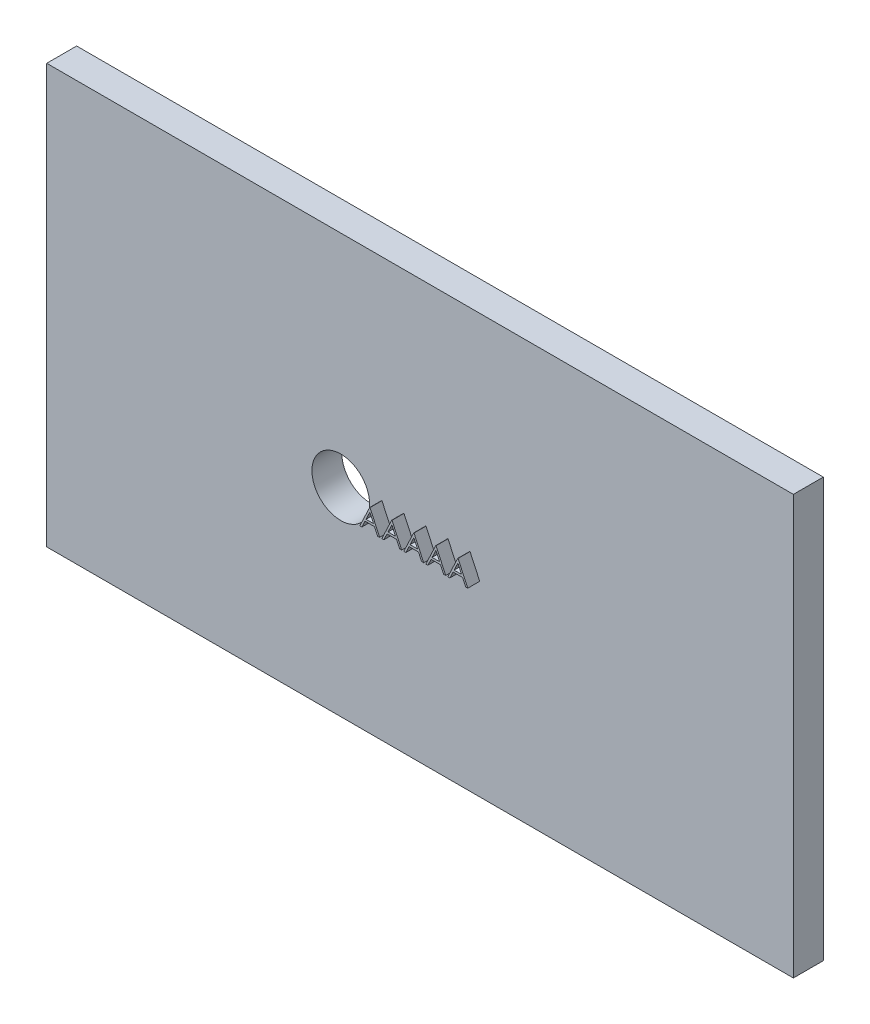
ISO-10303-21;
HEADER;
FILE_DESCRIPTION(('STEP AP214'),'2;1');
FILE_NAME('part.step','',(''),(''),'','','');
FILE_SCHEMA(('AUTOMOTIVE_DESIGN { 1 0 10303 214 1 1 1 1 }'));
ENDSEC;
DATA;
#1=APPLICATION_CONTEXT('core data for automotive mechanical design processes');
#2=APPLICATION_PROTOCOL_DEFINITION('international standard','automotive_design',2000,#1);
#3=PRODUCT_CONTEXT('',#1,'mechanical');
#4=PRODUCT('Part','Part','',(#3));
#5=PRODUCT_RELATED_PRODUCT_CATEGORY('part','',(#4));
#6=PRODUCT_DEFINITION_FORMATION('','',#4);
#7=PRODUCT_DEFINITION_CONTEXT('part definition',#1,'design');
#8=PRODUCT_DEFINITION('design','',#6,#7);
#9=PRODUCT_DEFINITION_SHAPE('','',#8);
#10=(LENGTH_UNIT() NAMED_UNIT(*) SI_UNIT(.MILLI.,.METRE.));
#11=(NAMED_UNIT(*) PLANE_ANGLE_UNIT() SI_UNIT($,.RADIAN.));
#12=(NAMED_UNIT(*) SI_UNIT($,.STERADIAN.) SOLID_ANGLE_UNIT());
#13=UNCERTAINTY_MEASURE_WITH_UNIT(LENGTH_MEASURE(1.E-05),#10,'distance_accuracy_value','');
#14=(GEOMETRIC_REPRESENTATION_CONTEXT(3) GLOBAL_UNCERTAINTY_ASSIGNED_CONTEXT((#13)) GLOBAL_UNIT_ASSIGNED_CONTEXT((#10,
#11,#12)) REPRESENTATION_CONTEXT('',''));
#15=CARTESIAN_POINT('',(0.,0.,0.));
#16=DIRECTION('',(0.,0.,1.));
#17=DIRECTION('',(1.,0.,0.));
#18=AXIS2_PLACEMENT_3D('',#15,#16,#17);
#19=CARTESIAN_POINT('',(0.,69.9787656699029,5.));
#20=DIRECTION('',(0.,0.,-1.));
#21=DIRECTION('',(-1.,0.,0.));
#22=AXIS2_PLACEMENT_3D('',#19,#20,#21);
#23=PLANE('',#22);
#24=DIRECTION('',(0.428584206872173,0.903501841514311,0.));
#25=VECTOR('',#24,1.);
#26=CARTESIAN_POINT('',(69.021886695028,31.1968236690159,5.));
#27=LINE('',#26,#25);
#28=CARTESIAN_POINT('',(69.021886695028,31.1968236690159,5.));
#29=VERTEX_POINT('',#28);
#30=CARTESIAN_POINT('',(70.6821431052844,34.6968236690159,5.));
#31=VERTEX_POINT('',#30);
#32=EDGE_CURVE('E440',#29,#31,#27,.T.);
#33=ORIENTED_EDGE('',*,*,#32,.T.);
#34=DIRECTION('',(1.,0.,0.));
#35=VECTOR('',#34,1.);
#36=CARTESIAN_POINT('',(70.6821431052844,34.6968236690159,5.));
#37=LINE('',#36,#35);
#38=CARTESIAN_POINT('',(70.7270149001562,34.6968236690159,5.));
#39=VERTEX_POINT('',#38);
#40=EDGE_CURVE('E421',#31,#39,#37,.T.);
#41=ORIENTED_EDGE('',*,*,#40,.T.);
#42=DIRECTION('',(0.419058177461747,-0.907959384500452,0.));
#43=VECTOR('',#42,1.);
#44=CARTESIAN_POINT('',(70.7270149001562,34.6968236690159,5.));
#45=LINE('',#44,#43);
#46=CARTESIAN_POINT('',(72.3423995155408,31.1968236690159,5.));
#47=VERTEX_POINT('',#46);
#48=EDGE_CURVE('E464',#39,#47,#45,.T.);
#49=ORIENTED_EDGE('',*,*,#48,.T.);
#50=DIRECTION('',(-1.,0.,0.));
#51=VECTOR('',#50,1.);
#52=CARTESIAN_POINT('',(72.3423995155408,31.1968236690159,5.));
#53=LINE('',#52,#51);
#54=CARTESIAN_POINT('',(72.0009532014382,31.1968236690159,5.));
#55=VERTEX_POINT('',#54);
#56=EDGE_CURVE('E48',#47,#55,#53,.T.);
#57=ORIENTED_EDGE('',*,*,#56,.T.);
#58=DIRECTION('',(-0.418842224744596,0.908059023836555,0.));
#59=VECTOR('',#58,1.);
#60=CARTESIAN_POINT('',(72.0009532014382,31.1968236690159,5.));
#61=LINE('',#60,#59);
#62=CARTESIAN_POINT('',(71.4835253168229,32.3186185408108,5.));
#63=VERTEX_POINT('',#62);
#64=EDGE_CURVE('E468',#55,#63,#61,.T.);
#65=ORIENTED_EDGE('',*,*,#64,.T.);
#66=DIRECTION('',(-1.,0.,0.));
#67=VECTOR('',#66,1.);
#68=CARTESIAN_POINT('',(71.4835253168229,32.3186185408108,5.));
#69=LINE('',#68,#67);
#70=CARTESIAN_POINT('',(69.896886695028,32.3186185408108,5.));
#71=VERTEX_POINT('',#70);
#72=EDGE_CURVE('E471',#63,#71,#69,.T.);
#73=ORIENTED_EDGE('',*,*,#72,.T.);
#74=DIRECTION('',(-0.428596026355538,-0.903496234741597,0.));
#75=VECTOR('',#74,1.);
#76=CARTESIAN_POINT('',(69.896886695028,32.3186185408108,5.));
#77=LINE('',#76,#75);
#78=CARTESIAN_POINT('',(69.3647352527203,31.1968236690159,5.));
#79=VERTEX_POINT('',#78);
#80=EDGE_CURVE('E474',#71,#79,#77,.T.);
#81=ORIENTED_EDGE('',*,*,#80,.T.);
#82=DIRECTION('',(-1.,0.,0.));
#83=VECTOR('',#82,1.);
#84=CARTESIAN_POINT('',(69.3647352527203,31.1968236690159,5.));
#85=LINE('',#84,#83);
#86=EDGE_CURVE('E477',#79,#29,#85,.T.);
#87=ORIENTED_EDGE('',*,*,#86,.T.);
#88=EDGE_LOOP('',(#33,#41,#49,#57,#65,#73,#81,#87));
#89=FACE_BOUND('',#88,.T.);
#90=DIRECTION('',(0.428584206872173,0.903501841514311,0.));
#91=VECTOR('',#90,1.);
#92=CARTESIAN_POINT('',(61.6629123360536,31.1968236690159,5.));
#93=LINE('',#92,#91);
#94=CARTESIAN_POINT('',(61.6629123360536,31.1968236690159,5.));
#95=VERTEX_POINT('',#94);
#96=CARTESIAN_POINT('',(63.32316874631,34.6968236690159,5.));
#97=VERTEX_POINT('',#96);
#98=EDGE_CURVE('E613',#95,#97,#93,.T.);
#99=ORIENTED_EDGE('',*,*,#98,.T.);
#100=DIRECTION('',(1.,0.,0.));
#101=VECTOR('',#100,1.);
#102=CARTESIAN_POINT('',(63.32316874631,34.6968236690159,5.));
#103=LINE('',#102,#101);
#104=CARTESIAN_POINT('',(63.3680405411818,34.6968236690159,5.));
#105=VERTEX_POINT('',#104);
#106=EDGE_CURVE('E608',#97,#105,#103,.T.);
#107=ORIENTED_EDGE('',*,*,#106,.T.);
#108=DIRECTION('',(0.419058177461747,-0.907959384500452,0.));
#109=VECTOR('',#108,1.);
#110=CARTESIAN_POINT('',(63.3680405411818,34.6968236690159,5.));
#111=LINE('',#110,#109);
#112=CARTESIAN_POINT('',(64.9834251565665,31.1968236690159,5.));
#113=VERTEX_POINT('',#112);
#114=EDGE_CURVE('E637',#105,#113,#111,.T.);
#115=ORIENTED_EDGE('',*,*,#114,.T.);
#116=DIRECTION('',(-1.,0.,0.));
#117=VECTOR('',#116,1.);
#118=CARTESIAN_POINT('',(64.9834251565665,31.1968236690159,5.));
#119=LINE('',#118,#117);
#120=CARTESIAN_POINT('',(64.6419788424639,31.1968236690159,5.));
#121=VERTEX_POINT('',#120);
#122=EDGE_CURVE('E640',#113,#121,#119,.T.);
#123=ORIENTED_EDGE('',*,*,#122,.T.);
#124=DIRECTION('',(-0.418842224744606,0.908059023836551,0.));
#125=VECTOR('',#124,1.);
#126=CARTESIAN_POINT('',(64.6419788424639,31.1968236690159,5.));
#127=LINE('',#126,#125);
#128=CARTESIAN_POINT('',(64.1245509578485,32.3186185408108,5.));
#129=VERTEX_POINT('',#128);
#130=EDGE_CURVE('E643',#121,#129,#127,.T.);
#131=ORIENTED_EDGE('',*,*,#130,.T.);
#132=DIRECTION('',(-1.,0.,0.));
#133=VECTOR('',#132,1.);
#134=CARTESIAN_POINT('',(64.1245509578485,32.3186185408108,5.));
#135=LINE('',#134,#133);
#136=CARTESIAN_POINT('',(62.5379123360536,32.3186185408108,5.));
#137=VERTEX_POINT('',#136);
#138=EDGE_CURVE('E646',#129,#137,#135,.T.);
#139=ORIENTED_EDGE('',*,*,#138,.T.);
#140=DIRECTION('',(-0.428596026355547,-0.903496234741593,0.));
#141=VECTOR('',#140,1.);
#142=CARTESIAN_POINT('',(62.5379123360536,32.3186185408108,5.));
#143=LINE('',#142,#141);
#144=CARTESIAN_POINT('',(62.0057608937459,31.1968236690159,5.));
#145=VERTEX_POINT('',#144);
#146=EDGE_CURVE('E649',#137,#145,#143,.T.);
#147=ORIENTED_EDGE('',*,*,#146,.T.);
#148=DIRECTION('',(-1.,0.,0.));
#149=VECTOR('',#148,1.);
#150=CARTESIAN_POINT('',(62.0057608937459,31.1968236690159,5.));
#151=LINE('',#150,#149);
#152=EDGE_CURVE('E652',#145,#95,#151,.T.);
#153=ORIENTED_EDGE('',*,*,#152,.T.);
#154=EDGE_LOOP('',(#99,#107,#115,#123,#131,#139,#147,#153));
#155=FACE_BOUND('',#154,.T.);
#156=DIRECTION('',(0.428584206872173,0.903501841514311,0.));
#157=VECTOR('',#156,1.);
#158=CARTESIAN_POINT('',(54.3039379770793,31.1968236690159,5.));
#159=LINE('',#158,#157);
#160=CARTESIAN_POINT('',(54.3039379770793,31.1968236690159,5.));
#161=VERTEX_POINT('',#160);
#162=CARTESIAN_POINT('',(55.9641943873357,34.6968236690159,5.));
#163=VERTEX_POINT('',#162);
#164=EDGE_CURVE('E789',#161,#163,#159,.T.);
#165=ORIENTED_EDGE('',*,*,#164,.T.);
#166=DIRECTION('',(1.,0.,0.));
#167=VECTOR('',#166,1.);
#168=CARTESIAN_POINT('',(55.9641943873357,34.6968236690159,5.));
#169=LINE('',#168,#167);
#170=CARTESIAN_POINT('',(56.0090661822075,34.6968236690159,5.));
#171=VERTEX_POINT('',#170);
#172=EDGE_CURVE('E784',#163,#171,#169,.T.);
#173=ORIENTED_EDGE('',*,*,#172,.T.);
#174=DIRECTION('',(0.419058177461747,-0.907959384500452,0.));
#175=VECTOR('',#174,1.);
#176=CARTESIAN_POINT('',(56.0090661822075,34.6968236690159,5.));
#177=LINE('',#176,#175);
#178=CARTESIAN_POINT('',(57.6244507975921,31.1968236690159,5.));
#179=VERTEX_POINT('',#178);
#180=EDGE_CURVE('E813',#171,#179,#177,.T.);
#181=ORIENTED_EDGE('',*,*,#180,.T.);
#182=DIRECTION('',(-1.,0.,0.));
#183=VECTOR('',#182,1.);
#184=CARTESIAN_POINT('',(57.6244507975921,31.1968236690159,5.));
#185=LINE('',#184,#183);
#186=CARTESIAN_POINT('',(57.2830044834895,31.1968236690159,5.));
#187=VERTEX_POINT('',#186);
#188=EDGE_CURVE('E816',#179,#187,#185,.T.);
#189=ORIENTED_EDGE('',*,*,#188,.T.);
#190=DIRECTION('',(-0.41884222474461,0.908059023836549,0.));
#191=VECTOR('',#190,1.);
#192=CARTESIAN_POINT('',(57.2830044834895,31.1968236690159,5.));
#193=LINE('',#192,#191);
#194=CARTESIAN_POINT('',(56.7655765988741,32.3186185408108,5.));
#195=VERTEX_POINT('',#194);
#196=EDGE_CURVE('E819',#187,#195,#193,.T.);
#197=ORIENTED_EDGE('',*,*,#196,.T.);
#198=DIRECTION('',(-1.,0.,0.));
#199=VECTOR('',#198,1.);
#200=CARTESIAN_POINT('',(56.7655765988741,32.3186185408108,5.));
#201=LINE('',#200,#199);
#202=CARTESIAN_POINT('',(55.1789379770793,32.3186185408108,5.));
#203=VERTEX_POINT('',#202);
#204=EDGE_CURVE('E822',#195,#203,#201,.T.);
#205=ORIENTED_EDGE('',*,*,#204,.T.);
#206=DIRECTION('',(-0.428596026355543,-0.903496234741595,0.));
#207=VECTOR('',#206,1.);
#208=CARTESIAN_POINT('',(55.1789379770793,32.3186185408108,5.));
#209=LINE('',#208,#207);
#210=CARTESIAN_POINT('',(54.6467865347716,31.1968236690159,5.));
#211=VERTEX_POINT('',#210);
#212=EDGE_CURVE('E825',#203,#211,#209,.T.);
#213=ORIENTED_EDGE('',*,*,#212,.T.);
#214=DIRECTION('',(-1.,0.,0.));
#215=VECTOR('',#214,1.);
#216=CARTESIAN_POINT('',(54.6467865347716,31.1968236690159,5.));
#217=LINE('',#216,#215);
#218=EDGE_CURVE('E828',#211,#161,#217,.T.);
#219=ORIENTED_EDGE('',*,*,#218,.T.);
#220=EDGE_LOOP('',(#165,#173,#181,#189,#197,#205,#213,#219));
#221=FACE_BOUND('',#220,.T.);
#222=CARTESIAN_POINT('',(49.1244507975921,33.1968236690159,5.));
#223=DIRECTION('',(0.,0.,1.));
#224=DIRECTION('',(1.,0.,0.));
#225=AXIS2_PLACEMENT_3D('',#222,#223,#224);
#226=CIRCLE('',#225,4.81492077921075);
#227=CARTESIAN_POINT('',(53.9393715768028,33.1968236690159,5.));
#228=VERTEX_POINT('',#227);
#229=EDGE_CURVE('E850',#228,#228,#226,.T.);
#230=ORIENTED_EDGE('',*,*,#229,.F.);
#231=EDGE_LOOP('',(#230));
#232=FACE_BOUND('',#231,.T.);
#233=DIRECTION('',(0.,-1.,0.));
#234=VECTOR('',#233,1.);
#235=CARTESIAN_POINT('',(0.,0.,5.));
#236=LINE('',#235,#234);
#237=CARTESIAN_POINT('',(0.,69.9787656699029,5.));
#238=VERTEX_POINT('',#237);
#239=CARTESIAN_POINT('',(0.,0.,5.));
#240=VERTEX_POINT('',#239);
#241=EDGE_CURVE('E856',#238,#240,#236,.T.);
#242=ORIENTED_EDGE('',*,*,#241,.T.);
#243=DIRECTION('',(1.,0.,0.));
#244=VECTOR('',#243,1.);
#245=CARTESIAN_POINT('',(0.,0.,5.));
#246=LINE('',#245,#244);
#247=CARTESIAN_POINT('',(124.744756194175,0.,5.));
#248=VERTEX_POINT('',#247);
#249=EDGE_CURVE('E859',#240,#248,#246,.T.);
#250=ORIENTED_EDGE('',*,*,#249,.T.);
#251=DIRECTION('',(0.,1.,0.));
#252=VECTOR('',#251,1.);
#253=CARTESIAN_POINT('',(124.744756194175,0.,5.));
#254=LINE('',#253,#252);
#255=CARTESIAN_POINT('',(124.744756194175,69.9787656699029,5.));
#256=VERTEX_POINT('',#255);
#257=EDGE_CURVE('E862',#248,#256,#254,.T.);
#258=ORIENTED_EDGE('',*,*,#257,.T.);
#259=DIRECTION('',(-1.,0.,0.));
#260=VECTOR('',#259,1.);
#261=CARTESIAN_POINT('',(0.,69.9787656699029,5.));
#262=LINE('',#261,#260);
#263=EDGE_CURVE('E864',#256,#238,#262,.T.);
#264=ORIENTED_EDGE('',*,*,#263,.T.);
#265=EDGE_LOOP('',(#242,#250,#258,#264));
#266=FACE_BOUND('',#265,.T.);
#267=DIRECTION('',(0.428584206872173,0.903501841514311,0.));
#268=VECTOR('',#267,1.);
#269=CARTESIAN_POINT('',(57.9834251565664,31.1968236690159,5.));
#270=LINE('',#269,#268);
#271=CARTESIAN_POINT('',(57.9834251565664,31.1968236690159,5.));
#272=VERTEX_POINT('',#271);
#273=CARTESIAN_POINT('',(59.6436815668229,34.6968236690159,5.));
#274=VERTEX_POINT('',#273);
#275=EDGE_CURVE('E701',#272,#274,#270,.T.);
#276=ORIENTED_EDGE('',*,*,#275,.T.);
#277=DIRECTION('',(1.,0.,0.));
#278=VECTOR('',#277,1.);
#279=CARTESIAN_POINT('',(59.6436815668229,34.6968236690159,5.));
#280=LINE('',#279,#278);
#281=CARTESIAN_POINT('',(59.6885533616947,34.6968236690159,5.));
#282=VERTEX_POINT('',#281);
#283=EDGE_CURVE('E696',#274,#282,#280,.T.);
#284=ORIENTED_EDGE('',*,*,#283,.T.);
#285=DIRECTION('',(0.419058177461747,-0.907959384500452,0.));
#286=VECTOR('',#285,1.);
#287=CARTESIAN_POINT('',(59.6885533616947,34.6968236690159,5.));
#288=LINE('',#287,#286);
#289=CARTESIAN_POINT('',(61.3039379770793,31.1968236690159,5.));
#290=VERTEX_POINT('',#289);
#291=EDGE_CURVE('E725',#282,#290,#288,.T.);
#292=ORIENTED_EDGE('',*,*,#291,.T.);
#293=DIRECTION('',(-1.,0.,0.));
#294=VECTOR('',#293,1.);
#295=CARTESIAN_POINT('',(61.3039379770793,31.1968236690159,5.));
#296=LINE('',#295,#294);
#297=CARTESIAN_POINT('',(60.9624916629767,31.1968236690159,5.));
#298=VERTEX_POINT('',#297);
#299=EDGE_CURVE('E728',#290,#298,#296,.T.);
#300=ORIENTED_EDGE('',*,*,#299,.T.);
#301=DIRECTION('',(-0.418842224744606,0.908059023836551,0.));
#302=VECTOR('',#301,1.);
#303=CARTESIAN_POINT('',(60.9624916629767,31.1968236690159,5.));
#304=LINE('',#303,#302);
#305=CARTESIAN_POINT('',(60.4450637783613,32.3186185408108,5.));
#306=VERTEX_POINT('',#305);
#307=EDGE_CURVE('E731',#298,#306,#304,.T.);
#308=ORIENTED_EDGE('',*,*,#307,.T.);
#309=DIRECTION('',(-1.,0.,0.));
#310=VECTOR('',#309,1.);
#311=CARTESIAN_POINT('',(60.4450637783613,32.3186185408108,5.));
#312=LINE('',#311,#310);
#313=CARTESIAN_POINT('',(58.8584251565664,32.3186185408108,5.));
#314=VERTEX_POINT('',#313);
#315=EDGE_CURVE('E734',#306,#314,#312,.T.);
#316=ORIENTED_EDGE('',*,*,#315,.T.);
#317=DIRECTION('',(-0.428596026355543,-0.903496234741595,0.));
#318=VECTOR('',#317,1.);
#319=CARTESIAN_POINT('',(58.8584251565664,32.3186185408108,5.));
#320=LINE('',#319,#318);
#321=CARTESIAN_POINT('',(58.3262737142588,31.1968236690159,5.));
#322=VERTEX_POINT('',#321);
#323=EDGE_CURVE('E737',#314,#322,#320,.T.);
#324=ORIENTED_EDGE('',*,*,#323,.T.);
#325=DIRECTION('',(-1.,0.,0.));
#326=VECTOR('',#325,1.);
#327=CARTESIAN_POINT('',(58.3262737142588,31.1968236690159,5.));
#328=LINE('',#327,#326);
#329=EDGE_CURVE('E740',#322,#272,#328,.T.);
#330=ORIENTED_EDGE('',*,*,#329,.T.);
#331=EDGE_LOOP('',(#276,#284,#292,#300,#308,#316,#324,#330));
#332=FACE_BOUND('',#331,.T.);
#333=DIRECTION('',(0.428584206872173,0.903501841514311,0.));
#334=VECTOR('',#333,1.);
#335=CARTESIAN_POINT('',(65.3423995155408,31.1968236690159,5.));
#336=LINE('',#335,#334);
#337=CARTESIAN_POINT('',(65.3423995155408,31.1968236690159,5.));
#338=VERTEX_POINT('',#337);
#339=CARTESIAN_POINT('',(67.0026559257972,34.6968236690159,5.));
#340=VERTEX_POINT('',#339);
#341=EDGE_CURVE('E525',#338,#340,#336,.T.);
#342=ORIENTED_EDGE('',*,*,#341,.T.);
#343=DIRECTION('',(1.,0.,0.));
#344=VECTOR('',#343,1.);
#345=CARTESIAN_POINT('',(67.0026559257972,34.6968236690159,5.));
#346=LINE('',#345,#344);
#347=CARTESIAN_POINT('',(67.047527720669,34.6968236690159,5.));
#348=VERTEX_POINT('',#347);
#349=EDGE_CURVE('E520',#340,#348,#346,.T.);
#350=ORIENTED_EDGE('',*,*,#349,.T.);
#351=DIRECTION('',(0.419058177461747,-0.907959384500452,0.));
#352=VECTOR('',#351,1.);
#353=CARTESIAN_POINT('',(67.047527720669,34.6968236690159,5.));
#354=LINE('',#353,#352);
#355=CARTESIAN_POINT('',(68.6629123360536,31.1968236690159,5.));
#356=VERTEX_POINT('',#355);
#357=EDGE_CURVE('E549',#348,#356,#354,.T.);
#358=ORIENTED_EDGE('',*,*,#357,.T.);
#359=DIRECTION('',(-1.,0.,0.));
#360=VECTOR('',#359,1.);
#361=CARTESIAN_POINT('',(68.6629123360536,31.1968236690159,5.));
#362=LINE('',#361,#360);
#363=CARTESIAN_POINT('',(68.3214660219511,31.1968236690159,5.));
#364=VERTEX_POINT('',#363);
#365=EDGE_CURVE('E552',#356,#364,#362,.T.);
#366=ORIENTED_EDGE('',*,*,#365,.T.);
#367=DIRECTION('',(-0.418842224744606,0.908059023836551,0.));
#368=VECTOR('',#367,1.);
#369=CARTESIAN_POINT('',(68.3214660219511,31.1968236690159,5.));
#370=LINE('',#369,#368);
#371=CARTESIAN_POINT('',(67.8040381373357,32.3186185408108,5.));
#372=VERTEX_POINT('',#371);
#373=EDGE_CURVE('E555',#364,#372,#370,.T.);
#374=ORIENTED_EDGE('',*,*,#373,.T.);
#375=DIRECTION('',(-1.,0.,0.));
#376=VECTOR('',#375,1.);
#377=CARTESIAN_POINT('',(67.8040381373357,32.3186185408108,5.));
#378=LINE('',#377,#376);
#379=CARTESIAN_POINT('',(66.2173995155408,32.3186185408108,5.));
#380=VERTEX_POINT('',#379);
#381=EDGE_CURVE('E558',#372,#380,#378,.T.);
#382=ORIENTED_EDGE('',*,*,#381,.T.);
#383=DIRECTION('',(-0.428596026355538,-0.903496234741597,0.));
#384=VECTOR('',#383,1.);
#385=CARTESIAN_POINT('',(66.2173995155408,32.3186185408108,5.));
#386=LINE('',#385,#384);
#387=CARTESIAN_POINT('',(65.6852480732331,31.1968236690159,5.));
#388=VERTEX_POINT('',#387);
#389=EDGE_CURVE('E561',#380,#388,#386,.T.);
#390=ORIENTED_EDGE('',*,*,#389,.T.);
#391=DIRECTION('',(-1.,0.,0.));
#392=VECTOR('',#391,1.);
#393=CARTESIAN_POINT('',(65.6852480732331,31.1968236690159,5.));
#394=LINE('',#393,#392);
#395=EDGE_CURVE('E564',#388,#338,#394,.T.);
#396=ORIENTED_EDGE('',*,*,#395,.T.);
#397=EDGE_LOOP('',(#342,#350,#358,#366,#374,#382,#390,#396));
#398=FACE_BOUND('',#397,.T.);
#399=ADVANCED_FACE('F33',(#89,#155,#221,#232,#266,#332,#398),#23,.F.);
#400=CARTESIAN_POINT('',(0.,69.9787656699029,0.));
#401=DIRECTION('',(0.,0.,-1.));
#402=DIRECTION('',(-1.,0.,0.));
#403=AXIS2_PLACEMENT_3D('',#400,#401,#402);
#404=PLANE('',#403);
#405=DIRECTION('',(0.,-1.,0.));
#406=VECTOR('',#405,1.);
#407=CARTESIAN_POINT('',(0.,0.,0.));
#408=LINE('',#407,#406);
#409=CARTESIAN_POINT('',(0.,69.9787656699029,0.));
#410=VERTEX_POINT('',#409);
#411=CARTESIAN_POINT('',(0.,0.,0.));
#412=VERTEX_POINT('',#411);
#413=EDGE_CURVE('E853',#410,#412,#408,.T.);
#414=ORIENTED_EDGE('',*,*,#413,.F.);
#415=DIRECTION('',(-1.,0.,0.));
#416=VECTOR('',#415,1.);
#417=CARTESIAN_POINT('',(0.,69.9787656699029,0.));
#418=LINE('',#417,#416);
#419=CARTESIAN_POINT('',(124.744756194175,69.9787656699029,0.));
#420=VERTEX_POINT('',#419);
#421=EDGE_CURVE('E860',#420,#410,#418,.T.);
#422=ORIENTED_EDGE('',*,*,#421,.F.);
#423=DIRECTION('',(0.,1.,0.));
#424=VECTOR('',#423,1.);
#425=CARTESIAN_POINT('',(124.744756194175,0.,0.));
#426=LINE('',#425,#424);
#427=CARTESIAN_POINT('',(124.744756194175,0.,0.));
#428=VERTEX_POINT('',#427);
#429=EDGE_CURVE('E871',#428,#420,#426,.T.);
#430=ORIENTED_EDGE('',*,*,#429,.F.);
#431=DIRECTION('',(1.,0.,0.));
#432=VECTOR('',#431,1.);
#433=CARTESIAN_POINT('',(0.,0.,0.));
#434=LINE('',#433,#432);
#435=EDGE_CURVE('E869',#412,#428,#434,.T.);
#436=ORIENTED_EDGE('',*,*,#435,.F.);
#437=EDGE_LOOP('',(#414,#422,#430,#436));
#438=FACE_BOUND('',#437,.T.);
#439=CARTESIAN_POINT('',(49.1244507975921,33.1968236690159,0.));
#440=DIRECTION('',(0.,0.,1.));
#441=DIRECTION('',(1.,0.,0.));
#442=AXIS2_PLACEMENT_3D('',#439,#440,#441);
#443=CIRCLE('',#442,4.81492077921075);
#444=CARTESIAN_POINT('',(53.9393715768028,33.1968236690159,0.));
#445=VERTEX_POINT('',#444);
#446=EDGE_CURVE('E835',#445,#445,#443,.T.);
#447=ORIENTED_EDGE('',*,*,#446,.T.);
#448=EDGE_LOOP('',(#447));
#449=FACE_BOUND('',#448,.T.);
#450=ADVANCED_FACE('F889',(#438,#449),#404,.T.);
#451=CARTESIAN_POINT('',(0.,0.,5.));
#452=DIRECTION('',(1.,0.,0.));
#453=DIRECTION('',(0.,0.,-1.));
#454=AXIS2_PLACEMENT_3D('',#451,#452,#453);
#455=PLANE('',#454);
#456=ORIENTED_EDGE('',*,*,#413,.T.);
#457=DIRECTION('',(0.,0.,-1.));
#458=VECTOR('',#457,1.);
#459=CARTESIAN_POINT('',(0.,0.,5.));
#460=LINE('',#459,#458);
#461=EDGE_CURVE('E11',#240,#412,#460,.T.);
#462=ORIENTED_EDGE('',*,*,#461,.F.);
#463=ORIENTED_EDGE('',*,*,#241,.F.);
#464=DIRECTION('',(0.,0.,-1.));
#465=VECTOR('',#464,1.);
#466=CARTESIAN_POINT('',(0.,69.9787656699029,5.));
#467=LINE('',#466,#465);
#468=EDGE_CURVE('E866',#238,#410,#467,.T.);
#469=ORIENTED_EDGE('',*,*,#468,.T.);
#470=EDGE_LOOP('',(#456,#462,#463,#469));
#471=FACE_BOUND('',#470,.T.);
#472=ADVANCED_FACE('F35',(#471),#455,.F.);
#473=CARTESIAN_POINT('',(0.,0.,5.));
#474=DIRECTION('',(0.,1.,0.));
#475=DIRECTION('',(0.,0.,1.));
#476=AXIS2_PLACEMENT_3D('',#473,#474,#475);
#477=PLANE('',#476);
#478=ORIENTED_EDGE('',*,*,#435,.T.);
#479=DIRECTION('',(0.,0.,-1.));
#480=VECTOR('',#479,1.);
#481=CARTESIAN_POINT('',(124.744756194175,0.,5.));
#482=LINE('',#481,#480);
#483=EDGE_CURVE('E41',#248,#428,#482,.T.);
#484=ORIENTED_EDGE('',*,*,#483,.F.);
#485=ORIENTED_EDGE('',*,*,#249,.F.);
#486=ORIENTED_EDGE('',*,*,#461,.T.);
#487=EDGE_LOOP('',(#478,#484,#485,#486));
#488=FACE_BOUND('',#487,.T.);
#489=ADVANCED_FACE('F900',(#488),#477,.F.);
#490=CARTESIAN_POINT('',(124.744756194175,0.,5.));
#491=DIRECTION('',(-1.,0.,0.));
#492=DIRECTION('',(0.,0.,1.));
#493=AXIS2_PLACEMENT_3D('',#490,#491,#492);
#494=PLANE('',#493);
#495=ORIENTED_EDGE('',*,*,#429,.T.);
#496=DIRECTION('',(0.,0.,-1.));
#497=VECTOR('',#496,1.);
#498=CARTESIAN_POINT('',(124.744756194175,69.9787656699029,5.));
#499=LINE('',#498,#497);
#500=EDGE_CURVE('E876',#256,#420,#499,.T.);
#501=ORIENTED_EDGE('',*,*,#500,.F.);
#502=ORIENTED_EDGE('',*,*,#257,.F.);
#503=ORIENTED_EDGE('',*,*,#483,.T.);
#504=EDGE_LOOP('',(#495,#501,#502,#503));
#505=FACE_BOUND('',#504,.T.);
#506=ADVANCED_FACE('F883',(#505),#494,.F.);
#507=CARTESIAN_POINT('',(0.,69.9787656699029,5.));
#508=DIRECTION('',(0.,-1.,0.));
#509=DIRECTION('',(0.,0.,-1.));
#510=AXIS2_PLACEMENT_3D('',#507,#508,#509);
#511=PLANE('',#510);
#512=ORIENTED_EDGE('',*,*,#421,.T.);
#513=ORIENTED_EDGE('',*,*,#468,.F.);
#514=ORIENTED_EDGE('',*,*,#263,.F.);
#515=ORIENTED_EDGE('',*,*,#500,.T.);
#516=EDGE_LOOP('',(#512,#513,#514,#515));
#517=FACE_BOUND('',#516,.T.);
#518=ADVANCED_FACE('F893',(#517),#511,.F.);
#519=CARTESIAN_POINT('',(49.1244507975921,33.1968236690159,5.));
#520=DIRECTION('',(0.,0.,-1.));
#521=DIRECTION('',(-1.,0.,0.));
#522=AXIS2_PLACEMENT_3D('',#519,#520,#521);
#523=CYLINDRICAL_SURFACE('',#522,4.81492077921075);
#524=ORIENTED_EDGE('',*,*,#229,.T.);
#525=EDGE_LOOP('',(#524));
#526=FACE_BOUND('',#525,.T.);
#527=ORIENTED_EDGE('',*,*,#446,.F.);
#528=EDGE_LOOP('',(#527));
#529=FACE_BOUND('',#528,.T.);
#530=ADVANCED_FACE('F1117',(#526,#529),#523,.F.);
#531=CARTESIAN_POINT('',(55.6686294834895,34.6968236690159,7.));
#532=DIRECTION('',(0.,0.,1.));
#533=DIRECTION('',(1.,0.,0.));
#534=AXIS2_PLACEMENT_3D('',#531,#532,#533);
#535=PLANE('',#534);
#536=DIRECTION('',(1.,0.,0.));
#537=VECTOR('',#536,1.);
#538=CARTESIAN_POINT('',(55.9641943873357,34.6968236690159,7.));
#539=LINE('',#538,#537);
#540=CARTESIAN_POINT('',(55.9641943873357,34.6968236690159,7.));
#541=VERTEX_POINT('',#540);
#542=CARTESIAN_POINT('',(56.0090661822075,34.6968236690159,7.));
#543=VERTEX_POINT('',#542);
#544=EDGE_CURVE('E785',#541,#543,#539,.T.);
#545=ORIENTED_EDGE('',*,*,#544,.F.);
#546=DIRECTION('',(0.428584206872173,0.903501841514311,0.));
#547=VECTOR('',#546,1.);
#548=CARTESIAN_POINT('',(54.3039379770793,31.1968236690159,7.));
#549=LINE('',#548,#547);
#550=CARTESIAN_POINT('',(54.3039379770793,31.1968236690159,7.));
#551=VERTEX_POINT('',#550);
#552=EDGE_CURVE('E807',#551,#541,#549,.T.);
#553=ORIENTED_EDGE('',*,*,#552,.F.);
#554=DIRECTION('',(-1.,0.,0.));
#555=VECTOR('',#554,1.);
#556=CARTESIAN_POINT('',(54.6467865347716,31.1968236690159,7.));
#557=LINE('',#556,#555);
#558=CARTESIAN_POINT('',(54.6467865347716,31.1968236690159,7.));
#559=VERTEX_POINT('',#558);
#560=EDGE_CURVE('E804',#559,#551,#557,.T.);
#561=ORIENTED_EDGE('',*,*,#560,.F.);
#562=DIRECTION('',(-0.428596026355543,-0.903496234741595,0.));
#563=VECTOR('',#562,1.);
#564=CARTESIAN_POINT('',(55.1789379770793,32.3186185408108,7.));
#565=LINE('',#564,#563);
#566=CARTESIAN_POINT('',(55.1789379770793,32.3186185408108,7.));
#567=VERTEX_POINT('',#566);
#568=EDGE_CURVE('E801',#567,#559,#565,.T.);
#569=ORIENTED_EDGE('',*,*,#568,.F.);
#570=DIRECTION('',(-1.,0.,0.));
#571=VECTOR('',#570,1.);
#572=CARTESIAN_POINT('',(56.7655765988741,32.3186185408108,7.));
#573=LINE('',#572,#571);
#574=CARTESIAN_POINT('',(56.7655765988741,32.3186185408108,7.));
#575=VERTEX_POINT('',#574);
#576=EDGE_CURVE('E798',#575,#567,#573,.T.);
#577=ORIENTED_EDGE('',*,*,#576,.F.);
#578=DIRECTION('',(-0.41884222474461,0.908059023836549,0.));
#579=VECTOR('',#578,1.);
#580=CARTESIAN_POINT('',(57.2830044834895,31.1968236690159,7.));
#581=LINE('',#580,#579);
#582=CARTESIAN_POINT('',(57.2830044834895,31.1968236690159,7.));
#583=VERTEX_POINT('',#582);
#584=EDGE_CURVE('E795',#583,#575,#581,.T.);
#585=ORIENTED_EDGE('',*,*,#584,.F.);
#586=DIRECTION('',(-1.,0.,0.));
#587=VECTOR('',#586,1.);
#588=CARTESIAN_POINT('',(57.6244507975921,31.1968236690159,7.));
#589=LINE('',#588,#587);
#590=CARTESIAN_POINT('',(57.6244507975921,31.1968236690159,7.));
#591=VERTEX_POINT('',#590);
#592=EDGE_CURVE('E792',#591,#583,#589,.T.);
#593=ORIENTED_EDGE('',*,*,#592,.F.);
#594=DIRECTION('',(0.419058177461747,-0.907959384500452,0.));
#595=VECTOR('',#594,1.);
#596=CARTESIAN_POINT('',(56.0090661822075,34.6968236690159,7.));
#597=LINE('',#596,#595);
#598=EDGE_CURVE('E788',#543,#591,#597,.T.);
#599=ORIENTED_EDGE('',*,*,#598,.F.);
#600=EDGE_LOOP('',(#545,#553,#561,#569,#577,#585,#593,#599));
#601=FACE_BOUND('',#600,.T.);
#602=DIRECTION('',(-0.428351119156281,-0.903612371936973,0.));
#603=VECTOR('',#602,1.);
#604=CARTESIAN_POINT('',(55.9831246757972,34.0146321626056,7.));
#605=LINE('',#604,#603);
#606=CARTESIAN_POINT('',(55.9831246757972,34.0146321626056,7.));
#607=VERTEX_POINT('',#606);
#608=CARTESIAN_POINT('',(55.3493105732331,32.6775928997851,7.));
#609=VERTEX_POINT('',#608);
#610=EDGE_CURVE('E764',#607,#609,#605,.T.);
#611=ORIENTED_EDGE('',*,*,#610,.F.);
#612=DIRECTION('',(-0.418997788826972,0.907987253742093,0.));
#613=VECTOR('',#612,1.);
#614=CARTESIAN_POINT('',(56.6001118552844,32.6775928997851,7.));
#615=LINE('',#614,#613);
#616=CARTESIAN_POINT('',(56.6001118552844,32.6775928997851,7.));
#617=VERTEX_POINT('',#616);
#618=EDGE_CURVE('E762',#617,#607,#615,.T.);
#619=ORIENTED_EDGE('',*,*,#618,.F.);
#620=DIRECTION('',(1.,0.,0.));
#621=VECTOR('',#620,1.);
#622=CARTESIAN_POINT('',(55.3493105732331,32.6775928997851,7.));
#623=LINE('',#622,#621);
#624=EDGE_CURVE('E768',#609,#617,#623,.T.);
#625=ORIENTED_EDGE('',*,*,#624,.F.);
#626=EDGE_LOOP('',(#611,#619,#625));
#627=FACE_BOUND('',#626,.T.);
#628=ADVANCED_FACE('F1113',(#601,#627),#535,.T.);
#629=CARTESIAN_POINT('',(55.9641943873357,34.6968236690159,7.));
#630=DIRECTION('',(0.,1.,0.));
#631=DIRECTION('',(0.,0.,1.));
#632=AXIS2_PLACEMENT_3D('',#629,#630,#631);
#633=PLANE('',#632);
#634=ORIENTED_EDGE('',*,*,#172,.F.);
#635=DIRECTION('',(0.,0.,-1.));
#636=VECTOR('',#635,1.);
#637=CARTESIAN_POINT('',(55.9641943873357,34.6968236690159,7.));
#638=LINE('',#637,#636);
#639=EDGE_CURVE('E833',#541,#163,#638,.T.);
#640=ORIENTED_EDGE('',*,*,#639,.F.);
#641=ORIENTED_EDGE('',*,*,#544,.T.);
#642=DIRECTION('',(0.,0.,-1.));
#643=VECTOR('',#642,1.);
#644=CARTESIAN_POINT('',(56.0090661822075,34.6968236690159,7.));
#645=LINE('',#644,#643);
#646=EDGE_CURVE('E810',#543,#171,#645,.T.);
#647=ORIENTED_EDGE('',*,*,#646,.T.);
#648=EDGE_LOOP('',(#634,#640,#641,#647));
#649=FACE_BOUND('',#648,.T.);
#650=ADVANCED_FACE('F1116',(#649),#633,.T.);
#651=CARTESIAN_POINT('',(54.3039379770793,31.1968236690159,7.));
#652=DIRECTION('',(-0.903501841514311,0.428584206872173,0.));
#653=DIRECTION('',(-0.428584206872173,-0.903501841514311,0.));
#654=AXIS2_PLACEMENT_3D('',#651,#652,#653);
#655=PLANE('',#654);
#656=ORIENTED_EDGE('',*,*,#164,.F.);
#657=DIRECTION('',(0.,0.,-1.));
#658=VECTOR('',#657,1.);
#659=CARTESIAN_POINT('',(54.3039379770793,31.1968236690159,7.));
#660=LINE('',#659,#658);
#661=EDGE_CURVE('E836',#551,#161,#660,.T.);
#662=ORIENTED_EDGE('',*,*,#661,.F.);
#663=ORIENTED_EDGE('',*,*,#552,.T.);
#664=ORIENTED_EDGE('',*,*,#639,.T.);
#665=EDGE_LOOP('',(#656,#662,#663,#664));
#666=FACE_BOUND('',#665,.T.);
#667=ADVANCED_FACE('F1119',(#666),#655,.T.);
#668=CARTESIAN_POINT('',(54.6467865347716,31.1968236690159,7.));
#669=DIRECTION('',(0.,-1.,0.));
#670=DIRECTION('',(0.,0.,-1.));
#671=AXIS2_PLACEMENT_3D('',#668,#669,#670);
#672=PLANE('',#671);
#673=ORIENTED_EDGE('',*,*,#218,.F.);
#674=DIRECTION('',(0.,0.,-1.));
#675=VECTOR('',#674,1.);
#676=CARTESIAN_POINT('',(54.6467865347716,31.1968236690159,7.));
#677=LINE('',#676,#675);
#678=EDGE_CURVE('E838',#559,#211,#677,.T.);
#679=ORIENTED_EDGE('',*,*,#678,.F.);
#680=ORIENTED_EDGE('',*,*,#560,.T.);
#681=ORIENTED_EDGE('',*,*,#661,.T.);
#682=EDGE_LOOP('',(#673,#679,#680,#681));
#683=FACE_BOUND('',#682,.T.);
#684=ADVANCED_FACE('F1122',(#683),#672,.T.);
#685=CARTESIAN_POINT('',(55.1789379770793,32.3186185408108,7.));
#686=DIRECTION('',(0.903496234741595,-0.428596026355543,0.));
#687=DIRECTION('',(0.428596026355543,0.903496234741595,0.));
#688=AXIS2_PLACEMENT_3D('',#685,#686,#687);
#689=PLANE('',#688);
#690=ORIENTED_EDGE('',*,*,#212,.F.);
#691=DIRECTION('',(0.,0.,-1.));
#692=VECTOR('',#691,1.);
#693=CARTESIAN_POINT('',(55.1789379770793,32.3186185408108,7.));
#694=LINE('',#693,#692);
#695=EDGE_CURVE('E840',#567,#203,#694,.T.);
#696=ORIENTED_EDGE('',*,*,#695,.F.);
#697=ORIENTED_EDGE('',*,*,#568,.T.);
#698=ORIENTED_EDGE('',*,*,#678,.T.);
#699=EDGE_LOOP('',(#690,#696,#697,#698));
#700=FACE_BOUND('',#699,.T.);
#701=ADVANCED_FACE('F1126',(#700),#689,.T.);
#702=CARTESIAN_POINT('',(56.7655765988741,32.3186185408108,7.));
#703=DIRECTION('',(0.,-1.,0.));
#704=DIRECTION('',(0.,0.,-1.));
#705=AXIS2_PLACEMENT_3D('',#702,#703,#704);
#706=PLANE('',#705);
#707=ORIENTED_EDGE('',*,*,#204,.F.);
#708=DIRECTION('',(0.,0.,-1.));
#709=VECTOR('',#708,1.);
#710=CARTESIAN_POINT('',(56.7655765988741,32.3186185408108,7.));
#711=LINE('',#710,#709);
#712=EDGE_CURVE('E842',#575,#195,#711,.T.);
#713=ORIENTED_EDGE('',*,*,#712,.F.);
#714=ORIENTED_EDGE('',*,*,#576,.T.);
#715=ORIENTED_EDGE('',*,*,#695,.T.);
#716=EDGE_LOOP('',(#707,#713,#714,#715));
#717=FACE_BOUND('',#716,.T.);
#718=ADVANCED_FACE('F1130',(#717),#706,.T.);
#719=CARTESIAN_POINT('',(57.2830044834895,31.1968236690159,7.));
#720=DIRECTION('',(-0.908059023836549,-0.41884222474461,0.));
#721=DIRECTION('',(0.41884222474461,-0.908059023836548,0.));
#722=AXIS2_PLACEMENT_3D('',#719,#720,#721);
#723=PLANE('',#722);
#724=ORIENTED_EDGE('',*,*,#196,.F.);
#725=DIRECTION('',(0.,0.,-1.));
#726=VECTOR('',#725,1.);
#727=CARTESIAN_POINT('',(57.2830044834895,31.1968236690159,7.));
#728=LINE('',#727,#726);
#729=EDGE_CURVE('E844',#583,#187,#728,.T.);
#730=ORIENTED_EDGE('',*,*,#729,.F.);
#731=ORIENTED_EDGE('',*,*,#584,.T.);
#732=ORIENTED_EDGE('',*,*,#712,.T.);
#733=EDGE_LOOP('',(#724,#730,#731,#732));
#734=FACE_BOUND('',#733,.T.);
#735=ADVANCED_FACE('F1134',(#734),#723,.T.);
#736=CARTESIAN_POINT('',(57.6244507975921,31.1968236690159,7.));
#737=DIRECTION('',(0.,-1.,0.));
#738=DIRECTION('',(0.,0.,-1.));
#739=AXIS2_PLACEMENT_3D('',#736,#737,#738);
#740=PLANE('',#739);
#741=ORIENTED_EDGE('',*,*,#188,.F.);
#742=DIRECTION('',(0.,0.,-1.));
#743=VECTOR('',#742,1.);
#744=CARTESIAN_POINT('',(57.6244507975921,31.1968236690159,7.));
#745=LINE('',#744,#743);
#746=EDGE_CURVE('E846',#591,#179,#745,.T.);
#747=ORIENTED_EDGE('',*,*,#746,.F.);
#748=ORIENTED_EDGE('',*,*,#592,.T.);
#749=ORIENTED_EDGE('',*,*,#729,.T.);
#750=EDGE_LOOP('',(#741,#747,#748,#749));
#751=FACE_BOUND('',#750,.T.);
#752=ADVANCED_FACE('F1138',(#751),#740,.T.);
#753=CARTESIAN_POINT('',(56.0090661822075,34.6968236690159,7.));
#754=DIRECTION('',(0.907959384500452,0.419058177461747,0.));
#755=DIRECTION('',(-0.419058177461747,0.907959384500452,0.));
#756=AXIS2_PLACEMENT_3D('',#753,#754,#755);
#757=PLANE('',#756);
#758=ORIENTED_EDGE('',*,*,#180,.F.);
#759=ORIENTED_EDGE('',*,*,#646,.F.);
#760=ORIENTED_EDGE('',*,*,#598,.T.);
#761=ORIENTED_EDGE('',*,*,#746,.T.);
#762=EDGE_LOOP('',(#758,#759,#760,#761));
#763=FACE_BOUND('',#762,.T.);
#764=ADVANCED_FACE('F1111',(#763),#757,.T.);
#765=CARTESIAN_POINT('',(56.6001118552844,32.6775928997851,7.));
#766=DIRECTION('',(-0.907987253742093,-0.418997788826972,0.));
#767=DIRECTION('',(0.418997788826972,-0.907987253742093,0.));
#768=AXIS2_PLACEMENT_3D('',#765,#766,#767);
#769=PLANE('',#768);
#770=DIRECTION('',(-0.418997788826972,0.907987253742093,0.));
#771=VECTOR('',#770,1.);
#772=CARTESIAN_POINT('',(56.6001118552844,32.6775928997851,5.));
#773=LINE('',#772,#771);
#774=CARTESIAN_POINT('',(56.6001118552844,32.6775928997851,5.));
#775=VERTEX_POINT('',#774);
#776=CARTESIAN_POINT('',(55.9831246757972,34.0146321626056,5.));
#777=VERTEX_POINT('',#776);
#778=EDGE_CURVE('E747',#775,#777,#773,.T.);
#779=ORIENTED_EDGE('',*,*,#778,.F.);
#780=DIRECTION('',(0.,0.,-1.));
#781=VECTOR('',#780,1.);
#782=CARTESIAN_POINT('',(56.6001118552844,32.6775928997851,7.));
#783=LINE('',#782,#781);
#784=EDGE_CURVE('E770',#617,#775,#783,.T.);
#785=ORIENTED_EDGE('',*,*,#784,.F.);
#786=ORIENTED_EDGE('',*,*,#618,.T.);
#787=DIRECTION('',(0.,0.,-1.));
#788=VECTOR('',#787,1.);
#789=CARTESIAN_POINT('',(55.9831246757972,34.0146321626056,7.));
#790=LINE('',#789,#788);
#791=EDGE_CURVE('E781',#607,#777,#790,.T.);
#792=ORIENTED_EDGE('',*,*,#791,.T.);
#793=EDGE_LOOP('',(#779,#785,#786,#792));
#794=FACE_BOUND('',#793,.T.);
#795=ADVANCED_FACE('F1107',(#794),#769,.T.);
#796=CARTESIAN_POINT('',(55.9831246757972,34.0146321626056,7.));
#797=DIRECTION('',(0.903612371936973,-0.428351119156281,0.));
#798=DIRECTION('',(0.428351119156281,0.903612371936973,0.));
#799=AXIS2_PLACEMENT_3D('',#796,#797,#798);
#800=PLANE('',#799);
#801=DIRECTION('',(-0.428351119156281,-0.903612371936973,0.));
#802=VECTOR('',#801,1.);
#803=CARTESIAN_POINT('',(55.9831246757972,34.0146321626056,5.));
#804=LINE('',#803,#802);
#805=CARTESIAN_POINT('',(55.3493105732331,32.6775928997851,5.));
#806=VERTEX_POINT('',#805);
#807=EDGE_CURVE('E773',#777,#806,#804,.T.);
#808=ORIENTED_EDGE('',*,*,#807,.F.);
#809=ORIENTED_EDGE('',*,*,#791,.F.);
#810=ORIENTED_EDGE('',*,*,#610,.T.);
#811=DIRECTION('',(0.,0.,-1.));
#812=VECTOR('',#811,1.);
#813=CARTESIAN_POINT('',(55.3493105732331,32.6775928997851,7.));
#814=LINE('',#813,#812);
#815=EDGE_CURVE('E779',#609,#806,#814,.T.);
#816=ORIENTED_EDGE('',*,*,#815,.T.);
#817=EDGE_LOOP('',(#808,#809,#810,#816));
#818=FACE_BOUND('',#817,.T.);
#819=ADVANCED_FACE('F934',(#818),#800,.T.);
#820=CARTESIAN_POINT('',(55.3493105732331,32.6775928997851,7.));
#821=DIRECTION('',(0.,1.,0.));
#822=DIRECTION('',(0.,0.,1.));
#823=AXIS2_PLACEMENT_3D('',#820,#821,#822);
#824=PLANE('',#823);
#825=DIRECTION('',(1.,0.,0.));
#826=VECTOR('',#825,1.);
#827=CARTESIAN_POINT('',(55.3493105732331,32.6775928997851,5.));
#828=LINE('',#827,#826);
#829=EDGE_CURVE('E765',#806,#775,#828,.T.);
#830=ORIENTED_EDGE('',*,*,#829,.F.);
#831=ORIENTED_EDGE('',*,*,#815,.F.);
#832=ORIENTED_EDGE('',*,*,#624,.T.);
#833=ORIENTED_EDGE('',*,*,#784,.T.);
#834=EDGE_LOOP('',(#830,#831,#832,#833));
#835=FACE_BOUND('',#834,.T.);
#836=ADVANCED_FACE('F924',(#835),#824,.T.);
#837=ORIENTED_EDGE('',*,*,#829,.T.);
#838=ORIENTED_EDGE('',*,*,#778,.T.);
#839=ORIENTED_EDGE('',*,*,#807,.T.);
#840=EDGE_LOOP('',(#837,#838,#839));
#841=FACE_BOUND('',#840,.T.);
#842=ADVANCED_FACE('F911',(#841),#23,.F.);
#843=CARTESIAN_POINT('',(59.3481166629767,34.6968236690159,7.));
#844=DIRECTION('',(0.,0.,1.));
#845=DIRECTION('',(1.,0.,0.));
#846=AXIS2_PLACEMENT_3D('',#843,#844,#845);
#847=PLANE('',#846);
#848=DIRECTION('',(1.,0.,0.));
#849=VECTOR('',#848,1.);
#850=CARTESIAN_POINT('',(59.6436815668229,34.6968236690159,7.));
#851=LINE('',#850,#849);
#852=CARTESIAN_POINT('',(59.6436815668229,34.6968236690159,7.));
#853=VERTEX_POINT('',#852);
#854=CARTESIAN_POINT('',(59.6885533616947,34.6968236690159,7.));
#855=VERTEX_POINT('',#854);
#856=EDGE_CURVE('E697',#853,#855,#851,.T.);
#857=ORIENTED_EDGE('',*,*,#856,.F.);
#858=DIRECTION('',(0.428584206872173,0.903501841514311,0.));
#859=VECTOR('',#858,1.);
#860=CARTESIAN_POINT('',(57.9834251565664,31.1968236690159,7.));
#861=LINE('',#860,#859);
#862=CARTESIAN_POINT('',(57.9834251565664,31.1968236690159,7.));
#863=VERTEX_POINT('',#862);
#864=EDGE_CURVE('E719',#863,#853,#861,.T.);
#865=ORIENTED_EDGE('',*,*,#864,.F.);
#866=DIRECTION('',(-1.,0.,0.));
#867=VECTOR('',#866,1.);
#868=CARTESIAN_POINT('',(58.3262737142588,31.1968236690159,7.));
#869=LINE('',#868,#867);
#870=CARTESIAN_POINT('',(58.3262737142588,31.1968236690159,7.));
#871=VERTEX_POINT('',#870);
#872=EDGE_CURVE('E716',#871,#863,#869,.T.);
#873=ORIENTED_EDGE('',*,*,#872,.F.);
#874=DIRECTION('',(-0.428596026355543,-0.903496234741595,0.));
#875=VECTOR('',#874,1.);
#876=CARTESIAN_POINT('',(58.8584251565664,32.3186185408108,7.));
#877=LINE('',#876,#875);
#878=CARTESIAN_POINT('',(58.8584251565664,32.3186185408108,7.));
#879=VERTEX_POINT('',#878);
#880=EDGE_CURVE('E713',#879,#871,#877,.T.);
#881=ORIENTED_EDGE('',*,*,#880,.F.);
#882=DIRECTION('',(-1.,0.,0.));
#883=VECTOR('',#882,1.);
#884=CARTESIAN_POINT('',(60.4450637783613,32.3186185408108,7.));
#885=LINE('',#884,#883);
#886=CARTESIAN_POINT('',(60.4450637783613,32.3186185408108,7.));
#887=VERTEX_POINT('',#886);
#888=EDGE_CURVE('E710',#887,#879,#885,.T.);
#889=ORIENTED_EDGE('',*,*,#888,.F.);
#890=DIRECTION('',(-0.418842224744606,0.908059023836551,0.));
#891=VECTOR('',#890,1.);
#892=CARTESIAN_POINT('',(60.9624916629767,31.1968236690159,7.));
#893=LINE('',#892,#891);
#894=CARTESIAN_POINT('',(60.9624916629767,31.1968236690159,7.));
#895=VERTEX_POINT('',#894);
#896=EDGE_CURVE('E707',#895,#887,#893,.T.);
#897=ORIENTED_EDGE('',*,*,#896,.F.);
#898=DIRECTION('',(-1.,0.,0.));
#899=VECTOR('',#898,1.);
#900=CARTESIAN_POINT('',(61.3039379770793,31.1968236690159,7.));
#901=LINE('',#900,#899);
#902=CARTESIAN_POINT('',(61.3039379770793,31.1968236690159,7.));
#903=VERTEX_POINT('',#902);
#904=EDGE_CURVE('E704',#903,#895,#901,.T.);
#905=ORIENTED_EDGE('',*,*,#904,.F.);
#906=DIRECTION('',(0.419058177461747,-0.907959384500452,0.));
#907=VECTOR('',#906,1.);
#908=CARTESIAN_POINT('',(59.6885533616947,34.6968236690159,7.));
#909=LINE('',#908,#907);
#910=EDGE_CURVE('E700',#855,#903,#909,.T.);
#911=ORIENTED_EDGE('',*,*,#910,.F.);
#912=EDGE_LOOP('',(#857,#865,#873,#881,#889,#897,#905,#911));
#913=FACE_BOUND('',#912,.T.);
#914=DIRECTION('',(-0.428351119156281,-0.903612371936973,0.));
#915=VECTOR('',#914,1.);
#916=CARTESIAN_POINT('',(59.6626118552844,34.0146321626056,7.));
#917=LINE('',#916,#915);
#918=CARTESIAN_POINT('',(59.6626118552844,34.0146321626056,7.));
#919=VERTEX_POINT('',#918);
#920=CARTESIAN_POINT('',(59.0287977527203,32.6775928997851,7.));
#921=VERTEX_POINT('',#920);
#922=EDGE_CURVE('E676',#919,#921,#917,.T.);
#923=ORIENTED_EDGE('',*,*,#922,.F.);
#924=DIRECTION('',(-0.418997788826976,0.907987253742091,0.));
#925=VECTOR('',#924,1.);
#926=CARTESIAN_POINT('',(60.2795990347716,32.6775928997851,7.));
#927=LINE('',#926,#925);
#928=CARTESIAN_POINT('',(60.2795990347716,32.6775928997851,7.));
#929=VERTEX_POINT('',#928);
#930=EDGE_CURVE('E674',#929,#919,#927,.T.);
#931=ORIENTED_EDGE('',*,*,#930,.F.);
#932=DIRECTION('',(1.,0.,0.));
#933=VECTOR('',#932,1.);
#934=CARTESIAN_POINT('',(59.0287977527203,32.6775928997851,7.));
#935=LINE('',#934,#933);
#936=EDGE_CURVE('E680',#921,#929,#935,.T.);
#937=ORIENTED_EDGE('',*,*,#936,.F.);
#938=EDGE_LOOP('',(#923,#931,#937));
#939=FACE_BOUND('',#938,.T.);
#940=ADVANCED_FACE('F923',(#913,#939),#847,.T.);
#941=CARTESIAN_POINT('',(59.6436815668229,34.6968236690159,7.));
#942=DIRECTION('',(0.,1.,0.));
#943=DIRECTION('',(0.,0.,1.));
#944=AXIS2_PLACEMENT_3D('',#941,#942,#943);
#945=PLANE('',#944);
#946=ORIENTED_EDGE('',*,*,#283,.F.);
#947=DIRECTION('',(0.,0.,-1.));
#948=VECTOR('',#947,1.);
#949=CARTESIAN_POINT('',(59.6436815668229,34.6968236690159,7.));
#950=LINE('',#949,#948);
#951=EDGE_CURVE('E745',#853,#274,#950,.T.);
#952=ORIENTED_EDGE('',*,*,#951,.F.);
#953=ORIENTED_EDGE('',*,*,#856,.T.);
#954=DIRECTION('',(0.,0.,-1.));
#955=VECTOR('',#954,1.);
#956=CARTESIAN_POINT('',(59.6885533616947,34.6968236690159,7.));
#957=LINE('',#956,#955);
#958=EDGE_CURVE('E722',#855,#282,#957,.T.);
#959=ORIENTED_EDGE('',*,*,#958,.T.);
#960=EDGE_LOOP('',(#946,#952,#953,#959));
#961=FACE_BOUND('',#960,.T.);
#962=ADVANCED_FACE('F931',(#961),#945,.T.);
#963=CARTESIAN_POINT('',(57.9834251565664,31.1968236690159,7.));
#964=DIRECTION('',(-0.903501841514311,0.428584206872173,0.));
#965=DIRECTION('',(-0.428584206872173,-0.903501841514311,0.));
#966=AXIS2_PLACEMENT_3D('',#963,#964,#965);
#967=PLANE('',#966);
#968=ORIENTED_EDGE('',*,*,#275,.F.);
#969=DIRECTION('',(0.,0.,-1.));
#970=VECTOR('',#969,1.);
#971=CARTESIAN_POINT('',(57.9834251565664,31.1968236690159,7.));
#972=LINE('',#971,#970);
#973=EDGE_CURVE('E748',#863,#272,#972,.T.);
#974=ORIENTED_EDGE('',*,*,#973,.F.);
#975=ORIENTED_EDGE('',*,*,#864,.T.);
#976=ORIENTED_EDGE('',*,*,#951,.T.);
#977=EDGE_LOOP('',(#968,#974,#975,#976));
#978=FACE_BOUND('',#977,.T.);
#979=ADVANCED_FACE('F1075',(#978),#967,.T.);
#980=CARTESIAN_POINT('',(58.3262737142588,31.1968236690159,7.));
#981=DIRECTION('',(0.,-1.,0.));
#982=DIRECTION('',(0.,0.,-1.));
#983=AXIS2_PLACEMENT_3D('',#980,#981,#982);
#984=PLANE('',#983);
#985=ORIENTED_EDGE('',*,*,#329,.F.);
#986=DIRECTION('',(0.,0.,-1.));
#987=VECTOR('',#986,1.);
#988=CARTESIAN_POINT('',(58.3262737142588,31.1968236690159,7.));
#989=LINE('',#988,#987);
#990=EDGE_CURVE('E750',#871,#322,#989,.T.);
#991=ORIENTED_EDGE('',*,*,#990,.F.);
#992=ORIENTED_EDGE('',*,*,#872,.T.);
#993=ORIENTED_EDGE('',*,*,#973,.T.);
#994=EDGE_LOOP('',(#985,#991,#992,#993));
#995=FACE_BOUND('',#994,.T.);
#996=ADVANCED_FACE('F1078',(#995),#984,.T.);
#997=CARTESIAN_POINT('',(58.8584251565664,32.3186185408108,7.));
#998=DIRECTION('',(0.903496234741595,-0.428596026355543,0.));
#999=DIRECTION('',(0.428596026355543,0.903496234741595,0.));
#1000=AXIS2_PLACEMENT_3D('',#997,#998,#999);
#1001=PLANE('',#1000);
#1002=ORIENTED_EDGE('',*,*,#323,.F.);
#1003=DIRECTION('',(0.,0.,-1.));
#1004=VECTOR('',#1003,1.);
#1005=CARTESIAN_POINT('',(58.8584251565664,32.3186185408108,7.));
#1006=LINE('',#1005,#1004);
#1007=EDGE_CURVE('E752',#879,#314,#1006,.T.);
#1008=ORIENTED_EDGE('',*,*,#1007,.F.);
#1009=ORIENTED_EDGE('',*,*,#880,.T.);
#1010=ORIENTED_EDGE('',*,*,#990,.T.);
#1011=EDGE_LOOP('',(#1002,#1008,#1009,#1010));
#1012=FACE_BOUND('',#1011,.T.);
#1013=ADVANCED_FACE('F1082',(#1012),#1001,.T.);
#1014=CARTESIAN_POINT('',(60.4450637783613,32.3186185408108,7.));
#1015=DIRECTION('',(0.,-1.,0.));
#1016=DIRECTION('',(0.,0.,-1.));
#1017=AXIS2_PLACEMENT_3D('',#1014,#1015,#1016);
#1018=PLANE('',#1017);
#1019=ORIENTED_EDGE('',*,*,#315,.F.);
#1020=DIRECTION('',(0.,0.,-1.));
#1021=VECTOR('',#1020,1.);
#1022=CARTESIAN_POINT('',(60.4450637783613,32.3186185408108,7.));
#1023=LINE('',#1022,#1021);
#1024=EDGE_CURVE('E754',#887,#306,#1023,.T.);
#1025=ORIENTED_EDGE('',*,*,#1024,.F.);
#1026=ORIENTED_EDGE('',*,*,#888,.T.);
#1027=ORIENTED_EDGE('',*,*,#1007,.T.);
#1028=EDGE_LOOP('',(#1019,#1025,#1026,#1027));
#1029=FACE_BOUND('',#1028,.T.);
#1030=ADVANCED_FACE('F1086',(#1029),#1018,.T.);
#1031=CARTESIAN_POINT('',(60.9624916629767,31.1968236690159,7.));
#1032=DIRECTION('',(-0.908059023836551,-0.418842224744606,0.));
#1033=DIRECTION('',(0.418842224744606,-0.908059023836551,0.));
#1034=AXIS2_PLACEMENT_3D('',#1031,#1032,#1033);
#1035=PLANE('',#1034);
#1036=ORIENTED_EDGE('',*,*,#307,.F.);
#1037=DIRECTION('',(0.,0.,-1.));
#1038=VECTOR('',#1037,1.);
#1039=CARTESIAN_POINT('',(60.9624916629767,31.1968236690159,7.));
#1040=LINE('',#1039,#1038);
#1041=EDGE_CURVE('E756',#895,#298,#1040,.T.);
#1042=ORIENTED_EDGE('',*,*,#1041,.F.);
#1043=ORIENTED_EDGE('',*,*,#896,.T.);
#1044=ORIENTED_EDGE('',*,*,#1024,.T.);
#1045=EDGE_LOOP('',(#1036,#1042,#1043,#1044));
#1046=FACE_BOUND('',#1045,.T.);
#1047=ADVANCED_FACE('F1090',(#1046),#1035,.T.);
#1048=CARTESIAN_POINT('',(61.3039379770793,31.1968236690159,7.));
#1049=DIRECTION('',(0.,-1.,0.));
#1050=DIRECTION('',(0.,0.,-1.));
#1051=AXIS2_PLACEMENT_3D('',#1048,#1049,#1050);
#1052=PLANE('',#1051);
#1053=ORIENTED_EDGE('',*,*,#299,.F.);
#1054=DIRECTION('',(0.,0.,-1.));
#1055=VECTOR('',#1054,1.);
#1056=CARTESIAN_POINT('',(61.3039379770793,31.1968236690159,7.));
#1057=LINE('',#1056,#1055);
#1058=EDGE_CURVE('E758',#903,#290,#1057,.T.);
#1059=ORIENTED_EDGE('',*,*,#1058,.F.);
#1060=ORIENTED_EDGE('',*,*,#904,.T.);
#1061=ORIENTED_EDGE('',*,*,#1041,.T.);
#1062=EDGE_LOOP('',(#1053,#1059,#1060,#1061));
#1063=FACE_BOUND('',#1062,.T.);
#1064=ADVANCED_FACE('F1094',(#1063),#1052,.T.);
#1065=CARTESIAN_POINT('',(59.6885533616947,34.6968236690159,7.));
#1066=DIRECTION('',(0.907959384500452,0.419058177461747,0.));
#1067=DIRECTION('',(-0.419058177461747,0.907959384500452,0.));
#1068=AXIS2_PLACEMENT_3D('',#1065,#1066,#1067);
#1069=PLANE('',#1068);
#1070=ORIENTED_EDGE('',*,*,#291,.F.);
#1071=ORIENTED_EDGE('',*,*,#958,.F.);
#1072=ORIENTED_EDGE('',*,*,#910,.T.);
#1073=ORIENTED_EDGE('',*,*,#1058,.T.);
#1074=EDGE_LOOP('',(#1070,#1071,#1072,#1073));
#1075=FACE_BOUND('',#1074,.T.);
#1076=ADVANCED_FACE('F1072',(#1075),#1069,.T.);
#1077=CARTESIAN_POINT('',(60.2795990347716,32.6775928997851,7.));
#1078=DIRECTION('',(-0.907987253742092,-0.418997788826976,0.));
#1079=DIRECTION('',(0.418997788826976,-0.907987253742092,0.));
#1080=AXIS2_PLACEMENT_3D('',#1077,#1078,#1079);
#1081=PLANE('',#1080);
#1082=DIRECTION('',(-0.418997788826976,0.907987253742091,0.));
#1083=VECTOR('',#1082,1.);
#1084=CARTESIAN_POINT('',(60.2795990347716,32.6775928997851,5.));
#1085=LINE('',#1084,#1083);
#1086=CARTESIAN_POINT('',(60.2795990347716,32.6775928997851,5.));
#1087=VERTEX_POINT('',#1086);
#1088=CARTESIAN_POINT('',(59.6626118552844,34.0146321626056,5.));
#1089=VERTEX_POINT('',#1088);
#1090=EDGE_CURVE('E659',#1087,#1089,#1085,.T.);
#1091=ORIENTED_EDGE('',*,*,#1090,.F.);
#1092=DIRECTION('',(0.,0.,-1.));
#1093=VECTOR('',#1092,1.);
#1094=CARTESIAN_POINT('',(60.2795990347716,32.6775928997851,7.));
#1095=LINE('',#1094,#1093);
#1096=EDGE_CURVE('E682',#929,#1087,#1095,.T.);
#1097=ORIENTED_EDGE('',*,*,#1096,.F.);
#1098=ORIENTED_EDGE('',*,*,#930,.T.);
#1099=DIRECTION('',(0.,0.,-1.));
#1100=VECTOR('',#1099,1.);
#1101=CARTESIAN_POINT('',(59.6626118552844,34.0146321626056,7.));
#1102=LINE('',#1101,#1100);
#1103=EDGE_CURVE('E693',#919,#1089,#1102,.T.);
#1104=ORIENTED_EDGE('',*,*,#1103,.T.);
#1105=EDGE_LOOP('',(#1091,#1097,#1098,#1104));
#1106=FACE_BOUND('',#1105,.T.);
#1107=ADVANCED_FACE('F1069',(#1106),#1081,.T.);
#1108=CARTESIAN_POINT('',(59.6626118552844,34.0146321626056,7.));
#1109=DIRECTION('',(0.903612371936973,-0.428351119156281,0.));
#1110=DIRECTION('',(0.428351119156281,0.903612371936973,0.));
#1111=AXIS2_PLACEMENT_3D('',#1108,#1109,#1110);
#1112=PLANE('',#1111);
#1113=DIRECTION('',(-0.428351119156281,-0.903612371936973,0.));
#1114=VECTOR('',#1113,1.);
#1115=CARTESIAN_POINT('',(59.6626118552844,34.0146321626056,5.));
#1116=LINE('',#1115,#1114);
#1117=CARTESIAN_POINT('',(59.0287977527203,32.6775928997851,5.));
#1118=VERTEX_POINT('',#1117);
#1119=EDGE_CURVE('E685',#1089,#1118,#1116,.T.);
#1120=ORIENTED_EDGE('',*,*,#1119,.F.);
#1121=ORIENTED_EDGE('',*,*,#1103,.F.);
#1122=ORIENTED_EDGE('',*,*,#922,.T.);
#1123=DIRECTION('',(0.,0.,-1.));
#1124=VECTOR('',#1123,1.);
#1125=CARTESIAN_POINT('',(59.0287977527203,32.6775928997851,7.));
#1126=LINE('',#1125,#1124);
#1127=EDGE_CURVE('E691',#921,#1118,#1126,.T.);
#1128=ORIENTED_EDGE('',*,*,#1127,.T.);
#1129=EDGE_LOOP('',(#1120,#1121,#1122,#1128));
#1130=FACE_BOUND('',#1129,.T.);
#1131=ADVANCED_FACE('F949',(#1130),#1112,.T.);
#1132=CARTESIAN_POINT('',(59.0287977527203,32.6775928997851,7.));
#1133=DIRECTION('',(0.,1.,0.));
#1134=DIRECTION('',(0.,0.,1.));
#1135=AXIS2_PLACEMENT_3D('',#1132,#1133,#1134);
#1136=PLANE('',#1135);
#1137=DIRECTION('',(1.,0.,0.));
#1138=VECTOR('',#1137,1.);
#1139=CARTESIAN_POINT('',(59.0287977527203,32.6775928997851,5.));
#1140=LINE('',#1139,#1138);
#1141=EDGE_CURVE('E677',#1118,#1087,#1140,.T.);
#1142=ORIENTED_EDGE('',*,*,#1141,.F.);
#1143=ORIENTED_EDGE('',*,*,#1127,.F.);
#1144=ORIENTED_EDGE('',*,*,#936,.T.);
#1145=ORIENTED_EDGE('',*,*,#1096,.T.);
#1146=EDGE_LOOP('',(#1142,#1143,#1144,#1145));
#1147=FACE_BOUND('',#1146,.T.);
#1148=ADVANCED_FACE('F939',(#1147),#1136,.T.);
#1149=ORIENTED_EDGE('',*,*,#1141,.T.);
#1150=ORIENTED_EDGE('',*,*,#1090,.T.);
#1151=ORIENTED_EDGE('',*,*,#1119,.T.);
#1152=EDGE_LOOP('',(#1149,#1150,#1151));
#1153=FACE_BOUND('',#1152,.T.);
#1154=ADVANCED_FACE('F926',(#1153),#23,.F.);
#1155=CARTESIAN_POINT('',(63.0276038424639,34.6968236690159,7.));
#1156=DIRECTION('',(0.,0.,1.));
#1157=DIRECTION('',(1.,0.,0.));
#1158=AXIS2_PLACEMENT_3D('',#1155,#1156,#1157);
#1159=PLANE('',#1158);
#1160=DIRECTION('',(1.,0.,0.));
#1161=VECTOR('',#1160,1.);
#1162=CARTESIAN_POINT('',(63.32316874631,34.6968236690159,7.));
#1163=LINE('',#1162,#1161);
#1164=CARTESIAN_POINT('',(63.32316874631,34.6968236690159,7.));
#1165=VERTEX_POINT('',#1164);
#1166=CARTESIAN_POINT('',(63.3680405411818,34.6968236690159,7.));
#1167=VERTEX_POINT('',#1166);
#1168=EDGE_CURVE('E609',#1165,#1167,#1163,.T.);
#1169=ORIENTED_EDGE('',*,*,#1168,.F.);
#1170=DIRECTION('',(0.428584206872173,0.903501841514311,0.));
#1171=VECTOR('',#1170,1.);
#1172=CARTESIAN_POINT('',(61.6629123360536,31.1968236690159,7.));
#1173=LINE('',#1172,#1171);
#1174=CARTESIAN_POINT('',(61.6629123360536,31.1968236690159,7.));
#1175=VERTEX_POINT('',#1174);
#1176=EDGE_CURVE('E631',#1175,#1165,#1173,.T.);
#1177=ORIENTED_EDGE('',*,*,#1176,.F.);
#1178=DIRECTION('',(-1.,0.,0.));
#1179=VECTOR('',#1178,1.);
#1180=CARTESIAN_POINT('',(62.0057608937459,31.1968236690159,7.));
#1181=LINE('',#1180,#1179);
#1182=CARTESIAN_POINT('',(62.0057608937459,31.1968236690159,7.));
#1183=VERTEX_POINT('',#1182);
#1184=EDGE_CURVE('E628',#1183,#1175,#1181,.T.);
#1185=ORIENTED_EDGE('',*,*,#1184,.F.);
#1186=DIRECTION('',(-0.428596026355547,-0.903496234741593,0.));
#1187=VECTOR('',#1186,1.);
#1188=CARTESIAN_POINT('',(62.5379123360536,32.3186185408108,7.));
#1189=LINE('',#1188,#1187);
#1190=CARTESIAN_POINT('',(62.5379123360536,32.3186185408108,7.));
#1191=VERTEX_POINT('',#1190);
#1192=EDGE_CURVE('E625',#1191,#1183,#1189,.T.);
#1193=ORIENTED_EDGE('',*,*,#1192,.F.);
#1194=DIRECTION('',(-1.,0.,0.));
#1195=VECTOR('',#1194,1.);
#1196=CARTESIAN_POINT('',(64.1245509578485,32.3186185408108,7.));
#1197=LINE('',#1196,#1195);
#1198=CARTESIAN_POINT('',(64.1245509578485,32.3186185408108,7.));
#1199=VERTEX_POINT('',#1198);
#1200=EDGE_CURVE('E622',#1199,#1191,#1197,.T.);
#1201=ORIENTED_EDGE('',*,*,#1200,.F.);
#1202=DIRECTION('',(-0.418842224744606,0.908059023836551,0.));
#1203=VECTOR('',#1202,1.);
#1204=CARTESIAN_POINT('',(64.6419788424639,31.1968236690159,7.));
#1205=LINE('',#1204,#1203);
#1206=CARTESIAN_POINT('',(64.6419788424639,31.1968236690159,7.));
#1207=VERTEX_POINT('',#1206);
#1208=EDGE_CURVE('E619',#1207,#1199,#1205,.T.);
#1209=ORIENTED_EDGE('',*,*,#1208,.F.);
#1210=DIRECTION('',(-1.,0.,0.));
#1211=VECTOR('',#1210,1.);
#1212=CARTESIAN_POINT('',(64.9834251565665,31.1968236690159,7.));
#1213=LINE('',#1212,#1211);
#1214=CARTESIAN_POINT('',(64.9834251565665,31.1968236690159,7.));
#1215=VERTEX_POINT('',#1214);
#1216=EDGE_CURVE('E616',#1215,#1207,#1213,.T.);
#1217=ORIENTED_EDGE('',*,*,#1216,.F.);
#1218=DIRECTION('',(0.419058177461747,-0.907959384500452,0.));
#1219=VECTOR('',#1218,1.);
#1220=CARTESIAN_POINT('',(63.3680405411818,34.6968236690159,7.));
#1221=LINE('',#1220,#1219);
#1222=EDGE_CURVE('E612',#1167,#1215,#1221,.T.);
#1223=ORIENTED_EDGE('',*,*,#1222,.F.);
#1224=EDGE_LOOP('',(#1169,#1177,#1185,#1193,#1201,#1209,#1217,#1223));
#1225=FACE_BOUND('',#1224,.T.);
#1226=DIRECTION('',(-0.428351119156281,-0.903612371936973,0.));
#1227=VECTOR('',#1226,1.);
#1228=CARTESIAN_POINT('',(63.3420990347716,34.0146321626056,7.));
#1229=LINE('',#1228,#1227);
#1230=CARTESIAN_POINT('',(63.3420990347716,34.0146321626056,7.));
#1231=VERTEX_POINT('',#1230);
#1232=CARTESIAN_POINT('',(62.7082849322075,32.6775928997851,7.));
#1233=VERTEX_POINT('',#1232);
#1234=EDGE_CURVE('E588',#1231,#1233,#1229,.T.);
#1235=ORIENTED_EDGE('',*,*,#1234,.F.);
#1236=DIRECTION('',(-0.418997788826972,0.907987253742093,0.));
#1237=VECTOR('',#1236,1.);
#1238=CARTESIAN_POINT('',(63.9590862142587,32.6775928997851,7.));
#1239=LINE('',#1238,#1237);
#1240=CARTESIAN_POINT('',(63.9590862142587,32.6775928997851,7.));
#1241=VERTEX_POINT('',#1240);
#1242=EDGE_CURVE('E586',#1241,#1231,#1239,.T.);
#1243=ORIENTED_EDGE('',*,*,#1242,.F.);
#1244=DIRECTION('',(1.,0.,0.));
#1245=VECTOR('',#1244,1.);
#1246=CARTESIAN_POINT('',(62.7082849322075,32.6775928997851,7.));
#1247=LINE('',#1246,#1245);
#1248=EDGE_CURVE('E592',#1233,#1241,#1247,.T.);
#1249=ORIENTED_EDGE('',*,*,#1248,.F.);
#1250=EDGE_LOOP('',(#1235,#1243,#1249));
#1251=FACE_BOUND('',#1250,.T.);
#1252=ADVANCED_FACE('F938',(#1225,#1251),#1159,.T.);
#1253=CARTESIAN_POINT('',(63.32316874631,34.6968236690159,7.));
#1254=DIRECTION('',(0.,1.,0.));
#1255=DIRECTION('',(0.,0.,1.));
#1256=AXIS2_PLACEMENT_3D('',#1253,#1254,#1255);
#1257=PLANE('',#1256);
#1258=ORIENTED_EDGE('',*,*,#106,.F.);
#1259=DIRECTION('',(0.,0.,-1.));
#1260=VECTOR('',#1259,1.);
#1261=CARTESIAN_POINT('',(63.32316874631,34.6968236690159,7.));
#1262=LINE('',#1261,#1260);
#1263=EDGE_CURVE('E657',#1165,#97,#1262,.T.);
#1264=ORIENTED_EDGE('',*,*,#1263,.F.);
#1265=ORIENTED_EDGE('',*,*,#1168,.T.);
#1266=DIRECTION('',(0.,0.,-1.));
#1267=VECTOR('',#1266,1.);
#1268=CARTESIAN_POINT('',(63.3680405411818,34.6968236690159,7.));
#1269=LINE('',#1268,#1267);
#1270=EDGE_CURVE('E634',#1167,#105,#1269,.T.);
#1271=ORIENTED_EDGE('',*,*,#1270,.T.);
#1272=EDGE_LOOP('',(#1258,#1264,#1265,#1271));
#1273=FACE_BOUND('',#1272,.T.);
#1274=ADVANCED_FACE('F946',(#1273),#1257,.T.);
#1275=CARTESIAN_POINT('',(61.6629123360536,31.1968236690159,7.));
#1276=DIRECTION('',(-0.903501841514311,0.428584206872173,0.));
#1277=DIRECTION('',(-0.428584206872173,-0.903501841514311,0.));
#1278=AXIS2_PLACEMENT_3D('',#1275,#1276,#1277);
#1279=PLANE('',#1278);
#1280=ORIENTED_EDGE('',*,*,#98,.F.);
#1281=DIRECTION('',(0.,0.,-1.));
#1282=VECTOR('',#1281,1.);
#1283=CARTESIAN_POINT('',(61.6629123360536,31.1968236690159,7.));
#1284=LINE('',#1283,#1282);
#1285=EDGE_CURVE('E660',#1175,#95,#1284,.T.);
#1286=ORIENTED_EDGE('',*,*,#1285,.F.);
#1287=ORIENTED_EDGE('',*,*,#1176,.T.);
#1288=ORIENTED_EDGE('',*,*,#1263,.T.);
#1289=EDGE_LOOP('',(#1280,#1286,#1287,#1288));
#1290=FACE_BOUND('',#1289,.T.);
#1291=ADVANCED_FACE('F1037',(#1290),#1279,.T.);
#1292=CARTESIAN_POINT('',(62.0057608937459,31.1968236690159,7.));
#1293=DIRECTION('',(0.,-1.,0.));
#1294=DIRECTION('',(0.,0.,-1.));
#1295=AXIS2_PLACEMENT_3D('',#1292,#1293,#1294);
#1296=PLANE('',#1295);
#1297=ORIENTED_EDGE('',*,*,#152,.F.);
#1298=DIRECTION('',(0.,0.,-1.));
#1299=VECTOR('',#1298,1.);
#1300=CARTESIAN_POINT('',(62.0057608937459,31.1968236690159,7.));
#1301=LINE('',#1300,#1299);
#1302=EDGE_CURVE('E662',#1183,#145,#1301,.T.);
#1303=ORIENTED_EDGE('',*,*,#1302,.F.);
#1304=ORIENTED_EDGE('',*,*,#1184,.T.);
#1305=ORIENTED_EDGE('',*,*,#1285,.T.);
#1306=EDGE_LOOP('',(#1297,#1303,#1304,#1305));
#1307=FACE_BOUND('',#1306,.T.);
#1308=ADVANCED_FACE('F1040',(#1307),#1296,.T.);
#1309=CARTESIAN_POINT('',(62.5379123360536,32.3186185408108,7.));
#1310=DIRECTION('',(0.903496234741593,-0.428596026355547,0.));
#1311=DIRECTION('',(0.428596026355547,0.903496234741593,0.));
#1312=AXIS2_PLACEMENT_3D('',#1309,#1310,#1311);
#1313=PLANE('',#1312);
#1314=ORIENTED_EDGE('',*,*,#146,.F.);
#1315=DIRECTION('',(0.,0.,-1.));
#1316=VECTOR('',#1315,1.);
#1317=CARTESIAN_POINT('',(62.5379123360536,32.3186185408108,7.));
#1318=LINE('',#1317,#1316);
#1319=EDGE_CURVE('E664',#1191,#137,#1318,.T.);
#1320=ORIENTED_EDGE('',*,*,#1319,.F.);
#1321=ORIENTED_EDGE('',*,*,#1192,.T.);
#1322=ORIENTED_EDGE('',*,*,#1302,.T.);
#1323=EDGE_LOOP('',(#1314,#1320,#1321,#1322));
#1324=FACE_BOUND('',#1323,.T.);
#1325=ADVANCED_FACE('F1044',(#1324),#1313,.T.);
#1326=CARTESIAN_POINT('',(64.1245509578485,32.3186185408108,7.));
#1327=DIRECTION('',(0.,-1.,0.));
#1328=DIRECTION('',(0.,0.,-1.));
#1329=AXIS2_PLACEMENT_3D('',#1326,#1327,#1328);
#1330=PLANE('',#1329);
#1331=ORIENTED_EDGE('',*,*,#138,.F.);
#1332=DIRECTION('',(0.,0.,-1.));
#1333=VECTOR('',#1332,1.);
#1334=CARTESIAN_POINT('',(64.1245509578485,32.3186185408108,7.));
#1335=LINE('',#1334,#1333);
#1336=EDGE_CURVE('E666',#1199,#129,#1335,.T.);
#1337=ORIENTED_EDGE('',*,*,#1336,.F.);
#1338=ORIENTED_EDGE('',*,*,#1200,.T.);
#1339=ORIENTED_EDGE('',*,*,#1319,.T.);
#1340=EDGE_LOOP('',(#1331,#1337,#1338,#1339));
#1341=FACE_BOUND('',#1340,.T.);
#1342=ADVANCED_FACE('F1048',(#1341),#1330,.T.);
#1343=CARTESIAN_POINT('',(64.6419788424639,31.1968236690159,7.));
#1344=DIRECTION('',(-0.908059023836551,-0.418842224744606,0.));
#1345=DIRECTION('',(0.418842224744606,-0.908059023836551,0.));
#1346=AXIS2_PLACEMENT_3D('',#1343,#1344,#1345);
#1347=PLANE('',#1346);
#1348=ORIENTED_EDGE('',*,*,#130,.F.);
#1349=DIRECTION('',(0.,0.,-1.));
#1350=VECTOR('',#1349,1.);
#1351=CARTESIAN_POINT('',(64.6419788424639,31.1968236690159,7.));
#1352=LINE('',#1351,#1350);
#1353=EDGE_CURVE('E668',#1207,#121,#1352,.T.);
#1354=ORIENTED_EDGE('',*,*,#1353,.F.);
#1355=ORIENTED_EDGE('',*,*,#1208,.T.);
#1356=ORIENTED_EDGE('',*,*,#1336,.T.);
#1357=EDGE_LOOP('',(#1348,#1354,#1355,#1356));
#1358=FACE_BOUND('',#1357,.T.);
#1359=ADVANCED_FACE('F1052',(#1358),#1347,.T.);
#1360=CARTESIAN_POINT('',(64.9834251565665,31.1968236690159,7.));
#1361=DIRECTION('',(0.,-1.,0.));
#1362=DIRECTION('',(0.,0.,-1.));
#1363=AXIS2_PLACEMENT_3D('',#1360,#1361,#1362);
#1364=PLANE('',#1363);
#1365=ORIENTED_EDGE('',*,*,#122,.F.);
#1366=DIRECTION('',(0.,0.,-1.));
#1367=VECTOR('',#1366,1.);
#1368=CARTESIAN_POINT('',(64.9834251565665,31.1968236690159,7.));
#1369=LINE('',#1368,#1367);
#1370=EDGE_CURVE('E670',#1215,#113,#1369,.T.);
#1371=ORIENTED_EDGE('',*,*,#1370,.F.);
#1372=ORIENTED_EDGE('',*,*,#1216,.T.);
#1373=ORIENTED_EDGE('',*,*,#1353,.T.);
#1374=EDGE_LOOP('',(#1365,#1371,#1372,#1373));
#1375=FACE_BOUND('',#1374,.T.);
#1376=ADVANCED_FACE('F1056',(#1375),#1364,.T.);
#1377=CARTESIAN_POINT('',(63.3680405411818,34.6968236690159,7.));
#1378=DIRECTION('',(0.907959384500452,0.419058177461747,0.));
#1379=DIRECTION('',(-0.419058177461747,0.907959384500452,0.));
#1380=AXIS2_PLACEMENT_3D('',#1377,#1378,#1379);
#1381=PLANE('',#1380);
#1382=ORIENTED_EDGE('',*,*,#114,.F.);
#1383=ORIENTED_EDGE('',*,*,#1270,.F.);
#1384=ORIENTED_EDGE('',*,*,#1222,.T.);
#1385=ORIENTED_EDGE('',*,*,#1370,.T.);
#1386=EDGE_LOOP('',(#1382,#1383,#1384,#1385));
#1387=FACE_BOUND('',#1386,.T.);
#1388=ADVANCED_FACE('F1034',(#1387),#1381,.T.);
#1389=CARTESIAN_POINT('',(63.9590862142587,32.6775928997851,7.));
#1390=DIRECTION('',(-0.907987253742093,-0.418997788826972,0.));
#1391=DIRECTION('',(0.418997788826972,-0.907987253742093,0.));
#1392=AXIS2_PLACEMENT_3D('',#1389,#1390,#1391);
#1393=PLANE('',#1392);
#1394=DIRECTION('',(-0.418997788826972,0.907987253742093,0.));
#1395=VECTOR('',#1394,1.);
#1396=CARTESIAN_POINT('',(63.9590862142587,32.6775928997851,5.));
#1397=LINE('',#1396,#1395);
#1398=CARTESIAN_POINT('',(63.9590862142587,32.6775928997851,5.));
#1399=VERTEX_POINT('',#1398);
#1400=CARTESIAN_POINT('',(63.3420990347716,34.0146321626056,5.));
#1401=VERTEX_POINT('',#1400);
#1402=EDGE_CURVE('E571',#1399,#1401,#1397,.T.);
#1403=ORIENTED_EDGE('',*,*,#1402,.F.);
#1404=DIRECTION('',(0.,0.,-1.));
#1405=VECTOR('',#1404,1.);
#1406=CARTESIAN_POINT('',(63.9590862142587,32.6775928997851,7.));
#1407=LINE('',#1406,#1405);
#1408=EDGE_CURVE('E594',#1241,#1399,#1407,.T.);
#1409=ORIENTED_EDGE('',*,*,#1408,.F.);
#1410=ORIENTED_EDGE('',*,*,#1242,.T.);
#1411=DIRECTION('',(0.,0.,-1.));
#1412=VECTOR('',#1411,1.);
#1413=CARTESIAN_POINT('',(63.3420990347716,34.0146321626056,7.));
#1414=LINE('',#1413,#1412);
#1415=EDGE_CURVE('E605',#1231,#1401,#1414,.T.);
#1416=ORIENTED_EDGE('',*,*,#1415,.T.);
#1417=EDGE_LOOP('',(#1403,#1409,#1410,#1416));
#1418=FACE_BOUND('',#1417,.T.);
#1419=ADVANCED_FACE('F1031',(#1418),#1393,.T.);
#1420=CARTESIAN_POINT('',(63.3420990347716,34.0146321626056,7.));
#1421=DIRECTION('',(0.903612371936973,-0.428351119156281,0.));
#1422=DIRECTION('',(0.428351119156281,0.903612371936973,0.));
#1423=AXIS2_PLACEMENT_3D('',#1420,#1421,#1422);
#1424=PLANE('',#1423);
#1425=DIRECTION('',(-0.428351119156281,-0.903612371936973,0.));
#1426=VECTOR('',#1425,1.);
#1427=CARTESIAN_POINT('',(63.3420990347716,34.0146321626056,5.));
#1428=LINE('',#1427,#1426);
#1429=CARTESIAN_POINT('',(62.7082849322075,32.6775928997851,5.));
#1430=VERTEX_POINT('',#1429);
#1431=EDGE_CURVE('E597',#1401,#1430,#1428,.T.);
#1432=ORIENTED_EDGE('',*,*,#1431,.F.);
#1433=ORIENTED_EDGE('',*,*,#1415,.F.);
#1434=ORIENTED_EDGE('',*,*,#1234,.T.);
#1435=DIRECTION('',(0.,0.,-1.));
#1436=VECTOR('',#1435,1.);
#1437=CARTESIAN_POINT('',(62.7082849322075,32.6775928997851,7.));
#1438=LINE('',#1437,#1436);
#1439=EDGE_CURVE('E603',#1233,#1430,#1438,.T.);
#1440=ORIENTED_EDGE('',*,*,#1439,.T.);
#1441=EDGE_LOOP('',(#1432,#1433,#1434,#1440));
#1442=FACE_BOUND('',#1441,.T.);
#1443=ADVANCED_FACE('F963',(#1442),#1424,.T.);
#1444=CARTESIAN_POINT('',(62.7082849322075,32.6775928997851,7.));
#1445=DIRECTION('',(0.,1.,0.));
#1446=DIRECTION('',(0.,0.,1.));
#1447=AXIS2_PLACEMENT_3D('',#1444,#1445,#1446);
#1448=PLANE('',#1447);
#1449=DIRECTION('',(1.,0.,0.));
#1450=VECTOR('',#1449,1.);
#1451=CARTESIAN_POINT('',(62.7082849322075,32.6775928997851,5.));
#1452=LINE('',#1451,#1450);
#1453=EDGE_CURVE('E589',#1430,#1399,#1452,.T.);
#1454=ORIENTED_EDGE('',*,*,#1453,.F.);
#1455=ORIENTED_EDGE('',*,*,#1439,.F.);
#1456=ORIENTED_EDGE('',*,*,#1248,.T.);
#1457=ORIENTED_EDGE('',*,*,#1408,.T.);
#1458=EDGE_LOOP('',(#1454,#1455,#1456,#1457));
#1459=FACE_BOUND('',#1458,.T.);
#1460=ADVANCED_FACE('F954',(#1459),#1448,.T.);
#1461=ORIENTED_EDGE('',*,*,#1453,.T.);
#1462=ORIENTED_EDGE('',*,*,#1402,.T.);
#1463=ORIENTED_EDGE('',*,*,#1431,.T.);
#1464=EDGE_LOOP('',(#1461,#1462,#1463));
#1465=FACE_BOUND('',#1464,.T.);
#1466=ADVANCED_FACE('F941',(#1465),#23,.F.);
#1467=CARTESIAN_POINT('',(66.7070910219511,34.6968236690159,7.));
#1468=DIRECTION('',(0.,0.,1.));
#1469=DIRECTION('',(1.,0.,0.));
#1470=AXIS2_PLACEMENT_3D('',#1467,#1468,#1469);
#1471=PLANE('',#1470);
#1472=DIRECTION('',(1.,0.,0.));
#1473=VECTOR('',#1472,1.);
#1474=CARTESIAN_POINT('',(67.0026559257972,34.6968236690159,7.));
#1475=LINE('',#1474,#1473);
#1476=CARTESIAN_POINT('',(67.0026559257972,34.6968236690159,7.));
#1477=VERTEX_POINT('',#1476);
#1478=CARTESIAN_POINT('',(67.047527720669,34.6968236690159,7.));
#1479=VERTEX_POINT('',#1478);
#1480=EDGE_CURVE('E521',#1477,#1479,#1475,.T.);
#1481=ORIENTED_EDGE('',*,*,#1480,.F.);
#1482=DIRECTION('',(0.428584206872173,0.903501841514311,0.));
#1483=VECTOR('',#1482,1.);
#1484=CARTESIAN_POINT('',(65.3423995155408,31.1968236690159,7.));
#1485=LINE('',#1484,#1483);
#1486=CARTESIAN_POINT('',(65.3423995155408,31.1968236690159,7.));
#1487=VERTEX_POINT('',#1486);
#1488=EDGE_CURVE('E543',#1487,#1477,#1485,.T.);
#1489=ORIENTED_EDGE('',*,*,#1488,.F.);
#1490=DIRECTION('',(-1.,0.,0.));
#1491=VECTOR('',#1490,1.);
#1492=CARTESIAN_POINT('',(65.6852480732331,31.1968236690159,7.));
#1493=LINE('',#1492,#1491);
#1494=CARTESIAN_POINT('',(65.6852480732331,31.1968236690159,7.));
#1495=VERTEX_POINT('',#1494);
#1496=EDGE_CURVE('E540',#1495,#1487,#1493,.T.);
#1497=ORIENTED_EDGE('',*,*,#1496,.F.);
#1498=DIRECTION('',(-0.428596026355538,-0.903496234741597,0.));
#1499=VECTOR('',#1498,1.);
#1500=CARTESIAN_POINT('',(66.2173995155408,32.3186185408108,7.));
#1501=LINE('',#1500,#1499);
#1502=CARTESIAN_POINT('',(66.2173995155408,32.3186185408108,7.));
#1503=VERTEX_POINT('',#1502);
#1504=EDGE_CURVE('E537',#1503,#1495,#1501,.T.);
#1505=ORIENTED_EDGE('',*,*,#1504,.F.);
#1506=DIRECTION('',(-1.,0.,0.));
#1507=VECTOR('',#1506,1.);
#1508=CARTESIAN_POINT('',(67.8040381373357,32.3186185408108,7.));
#1509=LINE('',#1508,#1507);
#1510=CARTESIAN_POINT('',(67.8040381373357,32.3186185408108,7.));
#1511=VERTEX_POINT('',#1510);
#1512=EDGE_CURVE('E534',#1511,#1503,#1509,.T.);
#1513=ORIENTED_EDGE('',*,*,#1512,.F.);
#1514=DIRECTION('',(-0.418842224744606,0.908059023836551,0.));
#1515=VECTOR('',#1514,1.);
#1516=CARTESIAN_POINT('',(68.3214660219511,31.1968236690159,7.));
#1517=LINE('',#1516,#1515);
#1518=CARTESIAN_POINT('',(68.3214660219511,31.1968236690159,7.));
#1519=VERTEX_POINT('',#1518);
#1520=EDGE_CURVE('E531',#1519,#1511,#1517,.T.);
#1521=ORIENTED_EDGE('',*,*,#1520,.F.);
#1522=DIRECTION('',(-1.,0.,0.));
#1523=VECTOR('',#1522,1.);
#1524=CARTESIAN_POINT('',(68.6629123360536,31.1968236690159,7.));
#1525=LINE('',#1524,#1523);
#1526=CARTESIAN_POINT('',(68.6629123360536,31.1968236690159,7.));
#1527=VERTEX_POINT('',#1526);
#1528=EDGE_CURVE('E528',#1527,#1519,#1525,.T.);
#1529=ORIENTED_EDGE('',*,*,#1528,.F.);
#1530=DIRECTION('',(0.419058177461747,-0.907959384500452,0.));
#1531=VECTOR('',#1530,1.);
#1532=CARTESIAN_POINT('',(67.047527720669,34.6968236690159,7.));
#1533=LINE('',#1532,#1531);
#1534=EDGE_CURVE('E524',#1479,#1527,#1533,.T.);
#1535=ORIENTED_EDGE('',*,*,#1534,.F.);
#1536=EDGE_LOOP('',(#1481,#1489,#1497,#1505,#1513,#1521,#1529,#1535));
#1537=FACE_BOUND('',#1536,.T.);
#1538=DIRECTION('',(-0.428351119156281,-0.903612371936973,0.));
#1539=VECTOR('',#1538,1.);
#1540=CARTESIAN_POINT('',(67.0215862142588,34.0146321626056,7.));
#1541=LINE('',#1540,#1539);
#1542=CARTESIAN_POINT('',(67.0215862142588,34.0146321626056,7.));
#1543=VERTEX_POINT('',#1542);
#1544=CARTESIAN_POINT('',(66.3877721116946,32.6775928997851,7.));
#1545=VERTEX_POINT('',#1544);
#1546=EDGE_CURVE('E500',#1543,#1545,#1541,.T.);
#1547=ORIENTED_EDGE('',*,*,#1546,.F.);
#1548=DIRECTION('',(-0.418997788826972,0.907987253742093,0.));
#1549=VECTOR('',#1548,1.);
#1550=CARTESIAN_POINT('',(67.6385733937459,32.6775928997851,7.));
#1551=LINE('',#1550,#1549);
#1552=CARTESIAN_POINT('',(67.6385733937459,32.6775928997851,7.));
#1553=VERTEX_POINT('',#1552);
#1554=EDGE_CURVE('E498',#1553,#1543,#1551,.T.);
#1555=ORIENTED_EDGE('',*,*,#1554,.F.);
#1556=DIRECTION('',(1.,0.,0.));
#1557=VECTOR('',#1556,1.);
#1558=CARTESIAN_POINT('',(66.3877721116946,32.6775928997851,7.));
#1559=LINE('',#1558,#1557);
#1560=EDGE_CURVE('E504',#1545,#1553,#1559,.T.);
#1561=ORIENTED_EDGE('',*,*,#1560,.F.);
#1562=EDGE_LOOP('',(#1547,#1555,#1561));
#1563=FACE_BOUND('',#1562,.T.);
#1564=ADVANCED_FACE('F953',(#1537,#1563),#1471,.T.);
#1565=CARTESIAN_POINT('',(67.0026559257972,34.6968236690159,7.));
#1566=DIRECTION('',(0.,1.,0.));
#1567=DIRECTION('',(0.,0.,1.));
#1568=AXIS2_PLACEMENT_3D('',#1565,#1566,#1567);
#1569=PLANE('',#1568);
#1570=ORIENTED_EDGE('',*,*,#349,.F.);
#1571=DIRECTION('',(0.,0.,-1.));
#1572=VECTOR('',#1571,1.);
#1573=CARTESIAN_POINT('',(67.0026559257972,34.6968236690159,7.));
#1574=LINE('',#1573,#1572);
#1575=EDGE_CURVE('E569',#1477,#340,#1574,.T.);
#1576=ORIENTED_EDGE('',*,*,#1575,.F.);
#1577=ORIENTED_EDGE('',*,*,#1480,.T.);
#1578=DIRECTION('',(0.,0.,-1.));
#1579=VECTOR('',#1578,1.);
#1580=CARTESIAN_POINT('',(67.047527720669,34.6968236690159,7.));
#1581=LINE('',#1580,#1579);
#1582=EDGE_CURVE('E546',#1479,#348,#1581,.T.);
#1583=ORIENTED_EDGE('',*,*,#1582,.T.);
#1584=EDGE_LOOP('',(#1570,#1576,#1577,#1583));
#1585=FACE_BOUND('',#1584,.T.);
#1586=ADVANCED_FACE('F960',(#1585),#1569,.T.);
#1587=CARTESIAN_POINT('',(65.3423995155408,31.1968236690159,7.));
#1588=DIRECTION('',(-0.903501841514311,0.428584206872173,0.));
#1589=DIRECTION('',(-0.428584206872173,-0.903501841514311,0.));
#1590=AXIS2_PLACEMENT_3D('',#1587,#1588,#1589);
#1591=PLANE('',#1590);
#1592=ORIENTED_EDGE('',*,*,#341,.F.);
#1593=DIRECTION('',(0.,0.,-1.));
#1594=VECTOR('',#1593,1.);
#1595=CARTESIAN_POINT('',(65.3423995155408,31.1968236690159,7.));
#1596=LINE('',#1595,#1594);
#1597=EDGE_CURVE('E572',#1487,#338,#1596,.T.);
#1598=ORIENTED_EDGE('',*,*,#1597,.F.);
#1599=ORIENTED_EDGE('',*,*,#1488,.T.);
#1600=ORIENTED_EDGE('',*,*,#1575,.T.);
#1601=EDGE_LOOP('',(#1592,#1598,#1599,#1600));
#1602=FACE_BOUND('',#1601,.T.);
#1603=ADVANCED_FACE('F999',(#1602),#1591,.T.);
#1604=CARTESIAN_POINT('',(65.6852480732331,31.1968236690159,7.));
#1605=DIRECTION('',(0.,-1.,0.));
#1606=DIRECTION('',(0.,0.,-1.));
#1607=AXIS2_PLACEMENT_3D('',#1604,#1605,#1606);
#1608=PLANE('',#1607);
#1609=ORIENTED_EDGE('',*,*,#395,.F.);
#1610=DIRECTION('',(0.,0.,-1.));
#1611=VECTOR('',#1610,1.);
#1612=CARTESIAN_POINT('',(65.6852480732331,31.1968236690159,7.));
#1613=LINE('',#1612,#1611);
#1614=EDGE_CURVE('E574',#1495,#388,#1613,.T.);
#1615=ORIENTED_EDGE('',*,*,#1614,.F.);
#1616=ORIENTED_EDGE('',*,*,#1496,.T.);
#1617=ORIENTED_EDGE('',*,*,#1597,.T.);
#1618=EDGE_LOOP('',(#1609,#1615,#1616,#1617));
#1619=FACE_BOUND('',#1618,.T.);
#1620=ADVANCED_FACE('F1002',(#1619),#1608,.T.);
#1621=CARTESIAN_POINT('',(66.2173995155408,32.3186185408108,7.));
#1622=DIRECTION('',(0.903496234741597,-0.428596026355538,0.));
#1623=DIRECTION('',(0.428596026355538,0.903496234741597,0.));
#1624=AXIS2_PLACEMENT_3D('',#1621,#1622,#1623);
#1625=PLANE('',#1624);
#1626=ORIENTED_EDGE('',*,*,#389,.F.);
#1627=DIRECTION('',(0.,0.,-1.));
#1628=VECTOR('',#1627,1.);
#1629=CARTESIAN_POINT('',(66.2173995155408,32.3186185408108,7.));
#1630=LINE('',#1629,#1628);
#1631=EDGE_CURVE('E576',#1503,#380,#1630,.T.);
#1632=ORIENTED_EDGE('',*,*,#1631,.F.);
#1633=ORIENTED_EDGE('',*,*,#1504,.T.);
#1634=ORIENTED_EDGE('',*,*,#1614,.T.);
#1635=EDGE_LOOP('',(#1626,#1632,#1633,#1634));
#1636=FACE_BOUND('',#1635,.T.);
#1637=ADVANCED_FACE('F1006',(#1636),#1625,.T.);
#1638=CARTESIAN_POINT('',(67.8040381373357,32.3186185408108,7.));
#1639=DIRECTION('',(0.,-1.,0.));
#1640=DIRECTION('',(0.,0.,-1.));
#1641=AXIS2_PLACEMENT_3D('',#1638,#1639,#1640);
#1642=PLANE('',#1641);
#1643=ORIENTED_EDGE('',*,*,#381,.F.);
#1644=DIRECTION('',(0.,0.,-1.));
#1645=VECTOR('',#1644,1.);
#1646=CARTESIAN_POINT('',(67.8040381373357,32.3186185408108,7.));
#1647=LINE('',#1646,#1645);
#1648=EDGE_CURVE('E578',#1511,#372,#1647,.T.);
#1649=ORIENTED_EDGE('',*,*,#1648,.F.);
#1650=ORIENTED_EDGE('',*,*,#1512,.T.);
#1651=ORIENTED_EDGE('',*,*,#1631,.T.);
#1652=EDGE_LOOP('',(#1643,#1649,#1650,#1651));
#1653=FACE_BOUND('',#1652,.T.);
#1654=ADVANCED_FACE('F1010',(#1653),#1642,.T.);
#1655=CARTESIAN_POINT('',(68.3214660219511,31.1968236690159,7.));
#1656=DIRECTION('',(-0.908059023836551,-0.418842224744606,0.));
#1657=DIRECTION('',(0.418842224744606,-0.908059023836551,0.));
#1658=AXIS2_PLACEMENT_3D('',#1655,#1656,#1657);
#1659=PLANE('',#1658);
#1660=ORIENTED_EDGE('',*,*,#373,.F.);
#1661=DIRECTION('',(0.,0.,-1.));
#1662=VECTOR('',#1661,1.);
#1663=CARTESIAN_POINT('',(68.3214660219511,31.1968236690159,7.));
#1664=LINE('',#1663,#1662);
#1665=EDGE_CURVE('E580',#1519,#364,#1664,.T.);
#1666=ORIENTED_EDGE('',*,*,#1665,.F.);
#1667=ORIENTED_EDGE('',*,*,#1520,.T.);
#1668=ORIENTED_EDGE('',*,*,#1648,.T.);
#1669=EDGE_LOOP('',(#1660,#1666,#1667,#1668));
#1670=FACE_BOUND('',#1669,.T.);
#1671=ADVANCED_FACE('F1014',(#1670),#1659,.T.);
#1672=CARTESIAN_POINT('',(68.6629123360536,31.1968236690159,7.));
#1673=DIRECTION('',(0.,-1.,0.));
#1674=DIRECTION('',(0.,0.,-1.));
#1675=AXIS2_PLACEMENT_3D('',#1672,#1673,#1674);
#1676=PLANE('',#1675);
#1677=ORIENTED_EDGE('',*,*,#365,.F.);
#1678=DIRECTION('',(0.,0.,-1.));
#1679=VECTOR('',#1678,1.);
#1680=CARTESIAN_POINT('',(68.6629123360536,31.1968236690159,7.));
#1681=LINE('',#1680,#1679);
#1682=EDGE_CURVE('E582',#1527,#356,#1681,.T.);
#1683=ORIENTED_EDGE('',*,*,#1682,.F.);
#1684=ORIENTED_EDGE('',*,*,#1528,.T.);
#1685=ORIENTED_EDGE('',*,*,#1665,.T.);
#1686=EDGE_LOOP('',(#1677,#1683,#1684,#1685));
#1687=FACE_BOUND('',#1686,.T.);
#1688=ADVANCED_FACE('F1018',(#1687),#1676,.T.);
#1689=CARTESIAN_POINT('',(67.047527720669,34.6968236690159,7.));
#1690=DIRECTION('',(0.907959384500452,0.419058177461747,0.));
#1691=DIRECTION('',(-0.419058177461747,0.907959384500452,0.));
#1692=AXIS2_PLACEMENT_3D('',#1689,#1690,#1691);
#1693=PLANE('',#1692);
#1694=ORIENTED_EDGE('',*,*,#357,.F.);
#1695=ORIENTED_EDGE('',*,*,#1582,.F.);
#1696=ORIENTED_EDGE('',*,*,#1534,.T.);
#1697=ORIENTED_EDGE('',*,*,#1682,.T.);
#1698=EDGE_LOOP('',(#1694,#1695,#1696,#1697));
#1699=FACE_BOUND('',#1698,.T.);
#1700=ADVANCED_FACE('F995',(#1699),#1693,.T.);
#1701=CARTESIAN_POINT('',(67.6385733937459,32.6775928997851,7.));
#1702=DIRECTION('',(-0.907987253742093,-0.418997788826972,0.));
#1703=DIRECTION('',(0.418997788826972,-0.907987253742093,0.));
#1704=AXIS2_PLACEMENT_3D('',#1701,#1702,#1703);
#1705=PLANE('',#1704);
#1706=DIRECTION('',(-0.418997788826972,0.907987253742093,0.));
#1707=VECTOR('',#1706,1.);
#1708=CARTESIAN_POINT('',(67.6385733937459,32.6775928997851,5.));
#1709=LINE('',#1708,#1707);
#1710=CARTESIAN_POINT('',(67.6385733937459,32.6775928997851,5.));
#1711=VERTEX_POINT('',#1710);
#1712=CARTESIAN_POINT('',(67.0215862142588,34.0146321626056,5.));
#1713=VERTEX_POINT('',#1712);
#1714=EDGE_CURVE('E484',#1711,#1713,#1709,.T.);
#1715=ORIENTED_EDGE('',*,*,#1714,.F.);
#1716=DIRECTION('',(0.,0.,-1.));
#1717=VECTOR('',#1716,1.);
#1718=CARTESIAN_POINT('',(67.6385733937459,32.6775928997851,7.));
#1719=LINE('',#1718,#1717);
#1720=EDGE_CURVE('E506',#1553,#1711,#1719,.T.);
#1721=ORIENTED_EDGE('',*,*,#1720,.F.);
#1722=ORIENTED_EDGE('',*,*,#1554,.T.);
#1723=DIRECTION('',(0.,0.,-1.));
#1724=VECTOR('',#1723,1.);
#1725=CARTESIAN_POINT('',(67.0215862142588,34.0146321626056,7.));
#1726=LINE('',#1725,#1724);
#1727=EDGE_CURVE('E517',#1543,#1713,#1726,.T.);
#1728=ORIENTED_EDGE('',*,*,#1727,.T.);
#1729=EDGE_LOOP('',(#1715,#1721,#1722,#1728));
#1730=FACE_BOUND('',#1729,.T.);
#1731=ADVANCED_FACE('F985',(#1730),#1705,.T.);
#1732=CARTESIAN_POINT('',(67.0215862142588,34.0146321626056,7.));
#1733=DIRECTION('',(0.903612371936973,-0.428351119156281,0.));
#1734=DIRECTION('',(0.428351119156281,0.903612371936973,0.));
#1735=AXIS2_PLACEMENT_3D('',#1732,#1733,#1734);
#1736=PLANE('',#1735);
#1737=DIRECTION('',(-0.428351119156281,-0.903612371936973,0.));
#1738=VECTOR('',#1737,1.);
#1739=CARTESIAN_POINT('',(67.0215862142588,34.0146321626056,5.));
#1740=LINE('',#1739,#1738);
#1741=CARTESIAN_POINT('',(66.3877721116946,32.6775928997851,5.));
#1742=VERTEX_POINT('',#1741);
#1743=EDGE_CURVE('E509',#1713,#1742,#1740,.T.);
#1744=ORIENTED_EDGE('',*,*,#1743,.F.);
#1745=ORIENTED_EDGE('',*,*,#1727,.F.);
#1746=ORIENTED_EDGE('',*,*,#1546,.T.);
#1747=DIRECTION('',(0.,0.,-1.));
#1748=VECTOR('',#1747,1.);
#1749=CARTESIAN_POINT('',(66.3877721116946,32.6775928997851,7.));
#1750=LINE('',#1749,#1748);
#1751=EDGE_CURVE('E515',#1545,#1742,#1750,.T.);
#1752=ORIENTED_EDGE('',*,*,#1751,.T.);
#1753=EDGE_LOOP('',(#1744,#1745,#1746,#1752));
#1754=FACE_BOUND('',#1753,.T.);
#1755=ADVANCED_FACE('F976',(#1754),#1736,.T.);
#1756=CARTESIAN_POINT('',(66.3877721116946,32.6775928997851,7.));
#1757=DIRECTION('',(0.,1.,0.));
#1758=DIRECTION('',(0.,0.,1.));
#1759=AXIS2_PLACEMENT_3D('',#1756,#1757,#1758);
#1760=PLANE('',#1759);
#1761=DIRECTION('',(1.,0.,0.));
#1762=VECTOR('',#1761,1.);
#1763=CARTESIAN_POINT('',(66.3877721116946,32.6775928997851,5.));
#1764=LINE('',#1763,#1762);
#1765=EDGE_CURVE('E501',#1742,#1711,#1764,.T.);
#1766=ORIENTED_EDGE('',*,*,#1765,.F.);
#1767=ORIENTED_EDGE('',*,*,#1751,.F.);
#1768=ORIENTED_EDGE('',*,*,#1560,.T.);
#1769=ORIENTED_EDGE('',*,*,#1720,.T.);
#1770=EDGE_LOOP('',(#1766,#1767,#1768,#1769));
#1771=FACE_BOUND('',#1770,.T.);
#1772=ADVANCED_FACE('F967',(#1771),#1760,.T.);
#1773=ORIENTED_EDGE('',*,*,#1765,.T.);
#1774=ORIENTED_EDGE('',*,*,#1714,.T.);
#1775=ORIENTED_EDGE('',*,*,#1743,.T.);
#1776=EDGE_LOOP('',(#1773,#1774,#1775));
#1777=FACE_BOUND('',#1776,.T.);
#1778=ADVANCED_FACE('F921',(#1777),#23,.F.);
#1779=CARTESIAN_POINT('',(70.3865782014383,34.6968236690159,7.));
#1780=DIRECTION('',(0.,0.,1.));
#1781=DIRECTION('',(1.,0.,0.));
#1782=AXIS2_PLACEMENT_3D('',#1779,#1780,#1781);
#1783=PLANE('',#1782);
#1784=DIRECTION('',(1.,0.,0.));
#1785=VECTOR('',#1784,1.);
#1786=CARTESIAN_POINT('',(70.6821431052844,34.6968236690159,7.));
#1787=LINE('',#1786,#1785);
#1788=CARTESIAN_POINT('',(70.6821431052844,34.6968236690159,7.));
#1789=VERTEX_POINT('',#1788);
#1790=CARTESIAN_POINT('',(70.7270149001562,34.6968236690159,7.));
#1791=VERTEX_POINT('',#1790);
#1792=EDGE_CURVE('E436',#1789,#1791,#1787,.T.);
#1793=ORIENTED_EDGE('',*,*,#1792,.F.);
#1794=DIRECTION('',(0.428584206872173,0.903501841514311,0.));
#1795=VECTOR('',#1794,1.);
#1796=CARTESIAN_POINT('',(69.021886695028,31.1968236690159,7.));
#1797=LINE('',#1796,#1795);
#1798=CARTESIAN_POINT('',(69.021886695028,31.1968236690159,7.));
#1799=VERTEX_POINT('',#1798);
#1800=EDGE_CURVE('E458',#1799,#1789,#1797,.T.);
#1801=ORIENTED_EDGE('',*,*,#1800,.F.);
#1802=DIRECTION('',(-1.,0.,0.));
#1803=VECTOR('',#1802,1.);
#1804=CARTESIAN_POINT('',(69.3647352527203,31.1968236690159,7.));
#1805=LINE('',#1804,#1803);
#1806=CARTESIAN_POINT('',(69.3647352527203,31.1968236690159,7.));
#1807=VERTEX_POINT('',#1806);
#1808=EDGE_CURVE('E455',#1807,#1799,#1805,.T.);
#1809=ORIENTED_EDGE('',*,*,#1808,.F.);
#1810=DIRECTION('',(-0.428596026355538,-0.903496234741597,0.));
#1811=VECTOR('',#1810,1.);
#1812=CARTESIAN_POINT('',(69.896886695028,32.3186185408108,7.));
#1813=LINE('',#1812,#1811);
#1814=CARTESIAN_POINT('',(69.896886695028,32.3186185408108,7.));
#1815=VERTEX_POINT('',#1814);
#1816=EDGE_CURVE('E452',#1815,#1807,#1813,.T.);
#1817=ORIENTED_EDGE('',*,*,#1816,.F.);
#1818=DIRECTION('',(-1.,0.,0.));
#1819=VECTOR('',#1818,1.);
#1820=CARTESIAN_POINT('',(71.4835253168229,32.3186185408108,7.));
#1821=LINE('',#1820,#1819);
#1822=CARTESIAN_POINT('',(71.4835253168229,32.3186185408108,7.));
#1823=VERTEX_POINT('',#1822);
#1824=EDGE_CURVE('E449',#1823,#1815,#1821,.T.);
#1825=ORIENTED_EDGE('',*,*,#1824,.F.);
#1826=DIRECTION('',(-0.418842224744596,0.908059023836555,0.));
#1827=VECTOR('',#1826,1.);
#1828=CARTESIAN_POINT('',(72.0009532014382,31.1968236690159,7.));
#1829=LINE('',#1828,#1827);
#1830=CARTESIAN_POINT('',(72.0009532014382,31.1968236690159,7.));
#1831=VERTEX_POINT('',#1830);
#1832=EDGE_CURVE('E446',#1831,#1823,#1829,.T.);
#1833=ORIENTED_EDGE('',*,*,#1832,.F.);
#1834=DIRECTION('',(-1.,0.,0.));
#1835=VECTOR('',#1834,1.);
#1836=CARTESIAN_POINT('',(72.3423995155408,31.1968236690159,7.));
#1837=LINE('',#1836,#1835);
#1838=CARTESIAN_POINT('',(72.3423995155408,31.1968236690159,7.));
#1839=VERTEX_POINT('',#1838);
#1840=EDGE_CURVE('E443',#1839,#1831,#1837,.T.);
#1841=ORIENTED_EDGE('',*,*,#1840,.F.);
#1842=DIRECTION('',(0.419058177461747,-0.907959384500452,0.));
#1843=VECTOR('',#1842,1.);
#1844=CARTESIAN_POINT('',(70.7270149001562,34.6968236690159,7.));
#1845=LINE('',#1844,#1843);
#1846=EDGE_CURVE('E439',#1791,#1839,#1845,.T.);
#1847=ORIENTED_EDGE('',*,*,#1846,.F.);
#1848=EDGE_LOOP('',(#1793,#1801,#1809,#1817,#1825,#1833,#1841,#1847));
#1849=FACE_BOUND('',#1848,.T.);
#1850=DIRECTION('',(-0.428351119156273,-0.903612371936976,0.));
#1851=VECTOR('',#1850,1.);
#1852=CARTESIAN_POINT('',(70.7010733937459,34.0146321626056,7.));
#1853=LINE('',#1852,#1851);
#1854=CARTESIAN_POINT('',(70.7010733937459,34.0146321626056,7.));
#1855=VERTEX_POINT('',#1854);
#1856=CARTESIAN_POINT('',(70.0672592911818,32.6775928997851,7.));
#1857=VERTEX_POINT('',#1856);
#1858=EDGE_CURVE('E413',#1855,#1857,#1853,.T.);
#1859=ORIENTED_EDGE('',*,*,#1858,.F.);
#1860=DIRECTION('',(-0.41899778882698,0.90798725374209,0.));
#1861=VECTOR('',#1860,1.);
#1862=CARTESIAN_POINT('',(71.3180605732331,32.6775928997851,7.));
#1863=LINE('',#1862,#1861);
#1864=CARTESIAN_POINT('',(71.3180605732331,32.6775928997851,7.));
#1865=VERTEX_POINT('',#1864);
#1866=EDGE_CURVE('E405',#1865,#1855,#1863,.T.);
#1867=ORIENTED_EDGE('',*,*,#1866,.F.);
#1868=DIRECTION('',(1.,0.,0.));
#1869=VECTOR('',#1868,1.);
#1870=CARTESIAN_POINT('',(70.0672592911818,32.6775928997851,7.));
#1871=LINE('',#1870,#1869);
#1872=EDGE_CURVE('E425',#1857,#1865,#1871,.T.);
#1873=ORIENTED_EDGE('',*,*,#1872,.F.);
#1874=EDGE_LOOP('',(#1859,#1867,#1873));
#1875=FACE_BOUND('',#1874,.T.);
#1876=ADVANCED_FACE('F424',(#1849,#1875),#1783,.T.);
#1877=CARTESIAN_POINT('',(70.6821431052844,34.6968236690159,7.));
#1878=DIRECTION('',(0.,1.,0.));
#1879=DIRECTION('',(0.,0.,1.));
#1880=AXIS2_PLACEMENT_3D('',#1877,#1878,#1879);
#1881=PLANE('',#1880);
#1882=ORIENTED_EDGE('',*,*,#40,.F.);
#1883=DIRECTION('',(0.,0.,-1.));
#1884=VECTOR('',#1883,1.);
#1885=CARTESIAN_POINT('',(70.6821431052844,34.6968236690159,7.));
#1886=LINE('',#1885,#1884);
#1887=EDGE_CURVE('E482',#1789,#31,#1886,.T.);
#1888=ORIENTED_EDGE('',*,*,#1887,.F.);
#1889=ORIENTED_EDGE('',*,*,#1792,.T.);
#1890=DIRECTION('',(0.,0.,-1.));
#1891=VECTOR('',#1890,1.);
#1892=CARTESIAN_POINT('',(70.7270149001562,34.6968236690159,7.));
#1893=LINE('',#1892,#1891);
#1894=EDGE_CURVE('E461',#1791,#39,#1893,.T.);
#1895=ORIENTED_EDGE('',*,*,#1894,.T.);
#1896=EDGE_LOOP('',(#1882,#1888,#1889,#1895));
#1897=FACE_BOUND('',#1896,.T.);
#1898=ADVANCED_FACE('F973',(#1897),#1881,.T.);
#1899=CARTESIAN_POINT('',(69.021886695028,31.1968236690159,7.));
#1900=DIRECTION('',(-0.903501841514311,0.428584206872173,0.));
#1901=DIRECTION('',(-0.428584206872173,-0.903501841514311,0.));
#1902=AXIS2_PLACEMENT_3D('',#1899,#1900,#1901);
#1903=PLANE('',#1902);
#1904=ORIENTED_EDGE('',*,*,#32,.F.);
#1905=DIRECTION('',(0.,0.,-1.));
#1906=VECTOR('',#1905,1.);
#1907=CARTESIAN_POINT('',(69.021886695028,31.1968236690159,7.));
#1908=LINE('',#1907,#1906);
#1909=EDGE_CURVE('E485',#1799,#29,#1908,.T.);
#1910=ORIENTED_EDGE('',*,*,#1909,.F.);
#1911=ORIENTED_EDGE('',*,*,#1800,.T.);
#1912=ORIENTED_EDGE('',*,*,#1887,.T.);
#1913=EDGE_LOOP('',(#1904,#1910,#1911,#1912));
#1914=FACE_BOUND('',#1913,.T.);
#1915=ADVANCED_FACE('F1431',(#1914),#1903,.T.);
#1916=CARTESIAN_POINT('',(69.3647352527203,31.1968236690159,7.));
#1917=DIRECTION('',(0.,-1.,0.));
#1918=DIRECTION('',(0.,0.,-1.));
#1919=AXIS2_PLACEMENT_3D('',#1916,#1917,#1918);
#1920=PLANE('',#1919);
#1921=ORIENTED_EDGE('',*,*,#86,.F.);
#1922=DIRECTION('',(0.,0.,-1.));
#1923=VECTOR('',#1922,1.);
#1924=CARTESIAN_POINT('',(69.3647352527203,31.1968236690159,7.));
#1925=LINE('',#1924,#1923);
#1926=EDGE_CURVE('E487',#1807,#79,#1925,.T.);
#1927=ORIENTED_EDGE('',*,*,#1926,.F.);
#1928=ORIENTED_EDGE('',*,*,#1808,.T.);
#1929=ORIENTED_EDGE('',*,*,#1909,.T.);
#1930=EDGE_LOOP('',(#1921,#1927,#1928,#1929));
#1931=FACE_BOUND('',#1930,.T.);
#1932=ADVANCED_FACE('F1440',(#1931),#1920,.T.);
#1933=CARTESIAN_POINT('',(69.896886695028,32.3186185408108,7.));
#1934=DIRECTION('',(0.903496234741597,-0.428596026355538,0.));
#1935=DIRECTION('',(0.428596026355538,0.903496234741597,0.));
#1936=AXIS2_PLACEMENT_3D('',#1933,#1934,#1935);
#1937=PLANE('',#1936);
#1938=ORIENTED_EDGE('',*,*,#80,.F.);
#1939=DIRECTION('',(0.,0.,-1.));
#1940=VECTOR('',#1939,1.);
#1941=CARTESIAN_POINT('',(69.896886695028,32.3186185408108,7.));
#1942=LINE('',#1941,#1940);
#1943=EDGE_CURVE('E489',#1815,#71,#1942,.T.);
#1944=ORIENTED_EDGE('',*,*,#1943,.F.);
#1945=ORIENTED_EDGE('',*,*,#1816,.T.);
#1946=ORIENTED_EDGE('',*,*,#1926,.T.);
#1947=EDGE_LOOP('',(#1938,#1944,#1945,#1946));
#1948=FACE_BOUND('',#1947,.T.);
#1949=ADVANCED_FACE('F1450',(#1948),#1937,.T.);
#1950=CARTESIAN_POINT('',(71.4835253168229,32.3186185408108,7.));
#1951=DIRECTION('',(0.,-1.,0.));
#1952=DIRECTION('',(0.,0.,-1.));
#1953=AXIS2_PLACEMENT_3D('',#1950,#1951,#1952);
#1954=PLANE('',#1953);
#1955=ORIENTED_EDGE('',*,*,#72,.F.);
#1956=DIRECTION('',(0.,0.,-1.));
#1957=VECTOR('',#1956,1.);
#1958=CARTESIAN_POINT('',(71.4835253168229,32.3186185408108,7.));
#1959=LINE('',#1958,#1957);
#1960=EDGE_CURVE('E491',#1823,#63,#1959,.T.);
#1961=ORIENTED_EDGE('',*,*,#1960,.F.);
#1962=ORIENTED_EDGE('',*,*,#1824,.T.);
#1963=ORIENTED_EDGE('',*,*,#1943,.T.);
#1964=EDGE_LOOP('',(#1955,#1961,#1962,#1963));
#1965=FACE_BOUND('',#1964,.T.);
#1966=ADVANCED_FACE('F1460',(#1965),#1954,.T.);
#1967=CARTESIAN_POINT('',(72.0009532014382,31.1968236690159,7.));
#1968=DIRECTION('',(-0.908059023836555,-0.418842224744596,0.));
#1969=DIRECTION('',(0.418842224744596,-0.908059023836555,0.));
#1970=AXIS2_PLACEMENT_3D('',#1967,#1968,#1969);
#1971=PLANE('',#1970);
#1972=ORIENTED_EDGE('',*,*,#64,.F.);
#1973=DIRECTION('',(0.,0.,-1.));
#1974=VECTOR('',#1973,1.);
#1975=CARTESIAN_POINT('',(72.0009532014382,31.1968236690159,7.));
#1976=LINE('',#1975,#1974);
#1977=EDGE_CURVE('E493',#1831,#55,#1976,.T.);
#1978=ORIENTED_EDGE('',*,*,#1977,.F.);
#1979=ORIENTED_EDGE('',*,*,#1832,.T.);
#1980=ORIENTED_EDGE('',*,*,#1960,.T.);
#1981=EDGE_LOOP('',(#1972,#1978,#1979,#1980));
#1982=FACE_BOUND('',#1981,.T.);
#1983=ADVANCED_FACE('F1470',(#1982),#1971,.T.);
#1984=CARTESIAN_POINT('',(72.3423995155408,31.1968236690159,7.));
#1985=DIRECTION('',(0.,-1.,0.));
#1986=DIRECTION('',(0.,0.,-1.));
#1987=AXIS2_PLACEMENT_3D('',#1984,#1985,#1986);
#1988=PLANE('',#1987);
#1989=ORIENTED_EDGE('',*,*,#56,.F.);
#1990=DIRECTION('',(0.,0.,-1.));
#1991=VECTOR('',#1990,1.);
#1992=CARTESIAN_POINT('',(72.3423995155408,31.1968236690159,7.));
#1993=LINE('',#1992,#1991);
#1994=EDGE_CURVE('E495',#1839,#47,#1993,.T.);
#1995=ORIENTED_EDGE('',*,*,#1994,.F.);
#1996=ORIENTED_EDGE('',*,*,#1840,.T.);
#1997=ORIENTED_EDGE('',*,*,#1977,.T.);
#1998=EDGE_LOOP('',(#1989,#1995,#1996,#1997));
#1999=FACE_BOUND('',#1998,.T.);
#2000=ADVANCED_FACE('F1480',(#1999),#1988,.T.);
#2001=CARTESIAN_POINT('',(70.7270149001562,34.6968236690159,7.));
#2002=DIRECTION('',(0.907959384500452,0.419058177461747,0.));
#2003=DIRECTION('',(-0.419058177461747,0.907959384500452,0.));
#2004=AXIS2_PLACEMENT_3D('',#2001,#2002,#2003);
#2005=PLANE('',#2004);
#2006=ORIENTED_EDGE('',*,*,#48,.F.);
#2007=ORIENTED_EDGE('',*,*,#1894,.F.);
#2008=ORIENTED_EDGE('',*,*,#1846,.T.);
#2009=ORIENTED_EDGE('',*,*,#1994,.T.);
#2010=EDGE_LOOP('',(#2006,#2007,#2008,#2009));
#2011=FACE_BOUND('',#2010,.T.);
#2012=ADVANCED_FACE('F1490',(#2011),#2005,.T.);
#2013=CARTESIAN_POINT('',(71.3180605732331,32.6775928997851,7.));
#2014=DIRECTION('',(-0.90798725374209,-0.41899778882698,0.));
#2015=DIRECTION('',(0.41899778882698,-0.90798725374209,0.));
#2016=AXIS2_PLACEMENT_3D('',#2013,#2014,#2015);
#2017=PLANE('',#2016);
#2018=DIRECTION('',(-0.41899778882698,0.90798725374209,0.));
#2019=VECTOR('',#2018,1.);
#2020=CARTESIAN_POINT('',(71.3180605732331,32.6775928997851,5.));
#2021=LINE('',#2020,#2019);
#2022=CARTESIAN_POINT('',(71.3180605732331,32.6775928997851,5.));
#2023=VERTEX_POINT('',#2022);
#2024=CARTESIAN_POINT('',(70.7010733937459,34.0146321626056,5.));
#2025=VERTEX_POINT('',#2024);
#2026=EDGE_CURVE('E429',#2023,#2025,#2021,.T.);
#2027=ORIENTED_EDGE('',*,*,#2026,.F.);
#2028=DIRECTION('',(0.,0.,-1.));
#2029=VECTOR('',#2028,1.);
#2030=CARTESIAN_POINT('',(71.3180605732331,32.6775928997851,7.));
#2031=LINE('',#2030,#2029);
#2032=EDGE_CURVE('E56',#1865,#2023,#2031,.T.);
#2033=ORIENTED_EDGE('',*,*,#2032,.F.);
#2034=ORIENTED_EDGE('',*,*,#1866,.T.);
#2035=DIRECTION('',(0.,0.,-1.));
#2036=VECTOR('',#2035,1.);
#2037=CARTESIAN_POINT('',(70.7010733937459,34.0146321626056,7.));
#2038=LINE('',#2037,#2036);
#2039=EDGE_CURVE('E408',#1855,#2025,#2038,.T.);
#2040=ORIENTED_EDGE('',*,*,#2039,.T.);
#2041=EDGE_LOOP('',(#2027,#2033,#2034,#2040));
#2042=FACE_BOUND('',#2041,.T.);
#2043=ADVANCED_FACE('F407',(#2042),#2017,.T.);
#2044=CARTESIAN_POINT('',(70.7010733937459,34.0146321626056,7.));
#2045=DIRECTION('',(0.903612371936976,-0.428351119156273,0.));
#2046=DIRECTION('',(0.428351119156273,0.903612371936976,0.));
#2047=AXIS2_PLACEMENT_3D('',#2044,#2045,#2046);
#2048=PLANE('',#2047);
#2049=DIRECTION('',(-0.428351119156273,-0.903612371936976,0.));
#2050=VECTOR('',#2049,1.);
#2051=CARTESIAN_POINT('',(70.7010733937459,34.0146321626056,5.));
#2052=LINE('',#2051,#2050);
#2053=CARTESIAN_POINT('',(70.0672592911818,32.6775928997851,5.));
#2054=VERTEX_POINT('',#2053);
#2055=EDGE_CURVE('E420',#2025,#2054,#2052,.T.);
#2056=ORIENTED_EDGE('',*,*,#2055,.F.);
#2057=ORIENTED_EDGE('',*,*,#2039,.F.);
#2058=ORIENTED_EDGE('',*,*,#1858,.T.);
#2059=DIRECTION('',(0.,0.,-1.));
#2060=VECTOR('',#2059,1.);
#2061=CARTESIAN_POINT('',(70.0672592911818,32.6775928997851,7.));
#2062=LINE('',#2061,#2060);
#2063=EDGE_CURVE('E422',#1857,#2054,#2062,.T.);
#2064=ORIENTED_EDGE('',*,*,#2063,.T.);
#2065=EDGE_LOOP('',(#2056,#2057,#2058,#2064));
#2066=FACE_BOUND('',#2065,.T.);
#2067=ADVANCED_FACE('F418',(#2066),#2048,.T.);
#2068=CARTESIAN_POINT('',(70.0672592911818,32.6775928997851,7.));
#2069=DIRECTION('',(0.,1.,0.));
#2070=DIRECTION('',(0.,0.,1.));
#2071=AXIS2_PLACEMENT_3D('',#2068,#2069,#2070);
#2072=PLANE('',#2071);
#2073=DIRECTION('',(1.,0.,0.));
#2074=VECTOR('',#2073,1.);
#2075=CARTESIAN_POINT('',(70.0672592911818,32.6775928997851,5.));
#2076=LINE('',#2075,#2074);
#2077=EDGE_CURVE('E414',#2054,#2023,#2076,.T.);
#2078=ORIENTED_EDGE('',*,*,#2077,.F.);
#2079=ORIENTED_EDGE('',*,*,#2063,.F.);
#2080=ORIENTED_EDGE('',*,*,#1872,.T.);
#2081=ORIENTED_EDGE('',*,*,#2032,.T.);
#2082=EDGE_LOOP('',(#2078,#2079,#2080,#2081));
#2083=FACE_BOUND('',#2082,.T.);
#2084=ADVANCED_FACE('F919',(#2083),#2072,.T.);
#2085=ORIENTED_EDGE('',*,*,#2077,.T.);
#2086=ORIENTED_EDGE('',*,*,#2026,.T.);
#2087=ORIENTED_EDGE('',*,*,#2055,.T.);
#2088=EDGE_LOOP('',(#2085,#2086,#2087));
#2089=FACE_BOUND('',#2088,.T.);
#2090=ADVANCED_FACE('F910',(#2089),#23,.F.);
#2091=CLOSED_SHELL('',(#399,#450,#472,#489,#506,#518,#530,#628,#650,#667,#684,#701,#718,#735,
#752,#764,#795,#819,#836,#842,#940,#962,#979,#996,#1013,#1030,#1047,#1064,#1076,#1107,#1131,
#1148,#1154,#1252,#1274,#1291,#1308,#1325,#1342,#1359,#1376,#1388,#1419,#1443,#1460,#1466,#1564,
#1586,#1603,#1620,#1637,#1654,#1671,#1688,#1700,#1731,#1755,#1772,#1778,#1876,#1898,#1915,#1932,
#1949,#1966,#1983,#2000,#2012,#2043,#2067,#2084,#2090));
#2092=MANIFOLD_SOLID_BREP('B2',#2091);
#2093=ADVANCED_BREP_SHAPE_REPRESENTATION('',(#18,#2092),#14);
#2094=SHAPE_DEFINITION_REPRESENTATION(#9,#2093);
ENDSEC;
END-ISO-10303-21;
